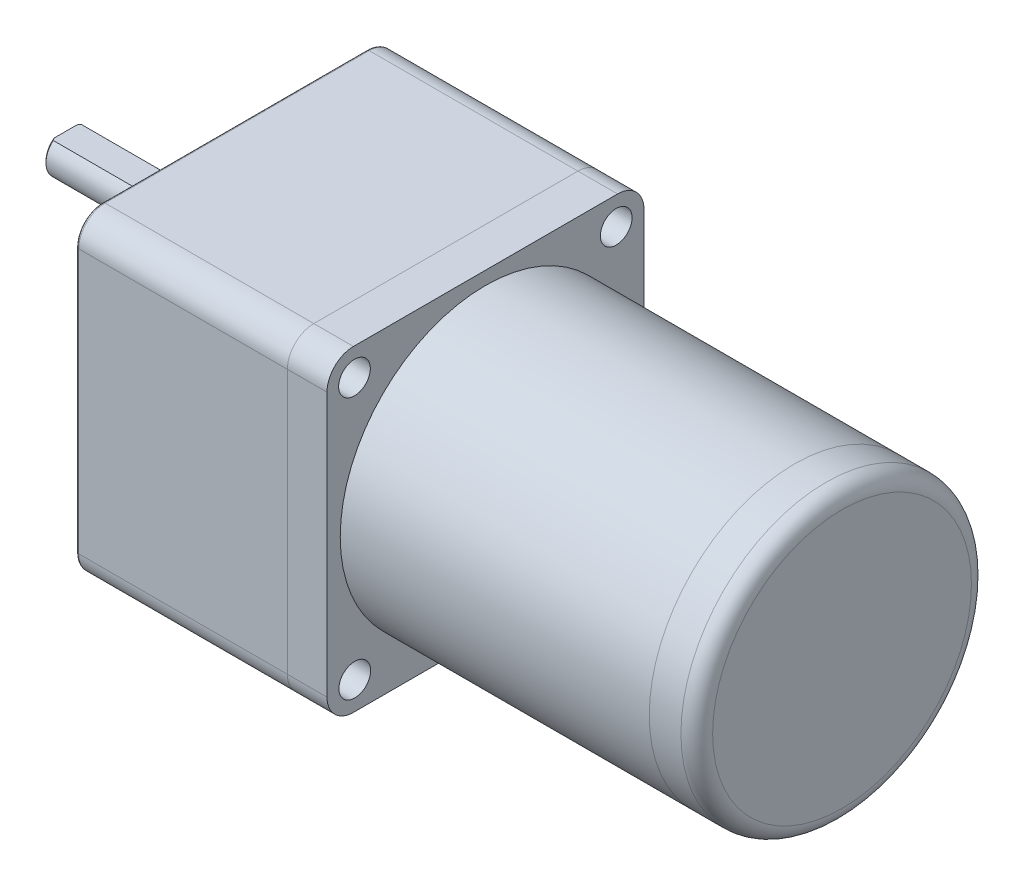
ISO-10303-21;
HEADER;
FILE_DESCRIPTION(('STEP AP214'),'2;1');
FILE_NAME('part.step','',(''),(''),'','','');
FILE_SCHEMA(('AUTOMOTIVE_DESIGN { 1 0 10303 214 1 1 1 1 }'));
ENDSEC;
DATA;
#1=APPLICATION_CONTEXT('core data for automotive mechanical design processes');
#2=APPLICATION_PROTOCOL_DEFINITION('international standard','automotive_design',2000,#1);
#3=PRODUCT_CONTEXT('',#1,'mechanical');
#4=PRODUCT('Part','Part','',(#3));
#5=PRODUCT_RELATED_PRODUCT_CATEGORY('part','',(#4));
#6=PRODUCT_DEFINITION_FORMATION('','',#4);
#7=PRODUCT_DEFINITION_CONTEXT('part definition',#1,'design');
#8=PRODUCT_DEFINITION('design','',#6,#7);
#9=PRODUCT_DEFINITION_SHAPE('','',#8);
#10=(LENGTH_UNIT() NAMED_UNIT(*) SI_UNIT(.MILLI.,.METRE.));
#11=(NAMED_UNIT(*) PLANE_ANGLE_UNIT() SI_UNIT($,.RADIAN.));
#12=(NAMED_UNIT(*) SI_UNIT($,.STERADIAN.) SOLID_ANGLE_UNIT());
#13=UNCERTAINTY_MEASURE_WITH_UNIT(LENGTH_MEASURE(1.E-05),#10,'distance_accuracy_value','');
#14=(GEOMETRIC_REPRESENTATION_CONTEXT(3) GLOBAL_UNCERTAINTY_ASSIGNED_CONTEXT((#13)) GLOBAL_UNIT_ASSIGNED_CONTEXT((#10,
#11,#12)) REPRESENTATION_CONTEXT('',''));
#15=CARTESIAN_POINT('',(0.,0.,0.));
#16=DIRECTION('',(0.,0.,1.));
#17=DIRECTION('',(1.,0.,0.));
#18=AXIS2_PLACEMENT_3D('',#15,#16,#17);
#19=CARTESIAN_POINT('',(-32.,10.,0.));
#20=DIRECTION('',(1.,0.,0.));
#21=DIRECTION('',(0.,0.,-1.));
#22=AXIS2_PLACEMENT_3D('',#19,#20,#21);
#23=CYLINDRICAL_SURFACE('',#22,4.);
#24=DIRECTION('',(-1.,0.,0.));
#25=VECTOR('',#24,1.);
#26=CARTESIAN_POINT('',(-7.,13.,2.64575131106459));
#27=LINE('',#26,#25);
#28=CARTESIAN_POINT('',(-7.,13.,2.64575131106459));
#29=VERTEX_POINT('',#28);
#30=CARTESIAN_POINT('',(-31.7,13.,2.64575131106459));
#31=VERTEX_POINT('',#30);
#32=EDGE_CURVE('E89',#29,#31,#27,.T.);
#33=ORIENTED_EDGE('',*,*,#32,.T.);
#34=CARTESIAN_POINT('',(-31.7,10.,0.));
#35=DIRECTION('',(-1.,0.,0.));
#36=DIRECTION('',(0.,0.,1.));
#37=AXIS2_PLACEMENT_3D('',#34,#35,#36);
#38=CIRCLE('',#37,4.);
#39=CARTESIAN_POINT('',(-31.7,13.,-2.64575131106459));
#40=VERTEX_POINT('',#39);
#41=EDGE_CURVE('E12',#31,#40,#38,.F.);
#42=ORIENTED_EDGE('',*,*,#41,.T.);
#43=DIRECTION('',(-1.,0.,0.));
#44=VECTOR('',#43,1.);
#45=CARTESIAN_POINT('',(-7.,13.,-2.64575131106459));
#46=LINE('',#45,#44);
#47=CARTESIAN_POINT('',(-7.,13.,-2.64575131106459));
#48=VERTEX_POINT('',#47);
#49=EDGE_CURVE('E87',#48,#40,#46,.T.);
#50=ORIENTED_EDGE('',*,*,#49,.F.);
#51=CARTESIAN_POINT('',(-7.,10.,0.));
#52=DIRECTION('',(-1.,0.,0.));
#53=DIRECTION('',(0.,0.,1.));
#54=AXIS2_PLACEMENT_3D('',#51,#52,#53);
#55=CIRCLE('',#54,4.);
#56=EDGE_CURVE('E80',#29,#48,#55,.T.);
#57=ORIENTED_EDGE('',*,*,#56,.F.);
#58=EDGE_LOOP('',(#33,#42,#50,#57));
#59=FACE_BOUND('',#58,.T.);
#60=CARTESIAN_POINT('',(-3.,10.,0.));
#61=DIRECTION('',(-1.,0.,0.));
#62=DIRECTION('',(0.,0.,1.));
#63=AXIS2_PLACEMENT_3D('',#60,#61,#62);
#64=CIRCLE('',#63,4.);
#65=CARTESIAN_POINT('',(-3.,10.,4.));
#66=VERTEX_POINT('',#65);
#67=EDGE_CURVE('E93',#66,#66,#64,.T.);
#68=ORIENTED_EDGE('',*,*,#67,.T.);
#69=EDGE_LOOP('',(#68));
#70=FACE_BOUND('',#69,.T.);
#71=ADVANCED_FACE('F46',(#59,#70),#23,.T.);
#72=CARTESIAN_POINT('',(-32.,10.,0.));
#73=DIRECTION('',(-1.,0.,0.));
#74=DIRECTION('',(0.,0.,1.));
#75=AXIS2_PLACEMENT_3D('',#72,#73,#74);
#76=PLANE('',#75);
#77=DIRECTION('',(0.,0.,1.));
#78=VECTOR('',#77,1.);
#79=CARTESIAN_POINT('',(-32.,13.,2.64575131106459));
#80=LINE('',#79,#78);
#81=CARTESIAN_POINT('',(-32.,13.,-2.16564078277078));
#82=VERTEX_POINT('',#81);
#83=CARTESIAN_POINT('',(-32.,13.,2.16564078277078));
#84=VERTEX_POINT('',#83);
#85=EDGE_CURVE('E84',#82,#84,#80,.T.);
#86=ORIENTED_EDGE('',*,*,#85,.F.);
#87=CARTESIAN_POINT('',(-32.,10.,0.));
#88=DIRECTION('',(-1.,0.,0.));
#89=DIRECTION('',(0.,0.,1.));
#90=AXIS2_PLACEMENT_3D('',#87,#88,#89);
#91=CIRCLE('',#90,3.70000000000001);
#92=EDGE_CURVE('E99',#82,#84,#91,.T.);
#93=ORIENTED_EDGE('',*,*,#92,.T.);
#94=EDGE_LOOP('',(#86,#93));
#95=FACE_BOUND('',#94,.T.);
#96=ADVANCED_FACE('F115',(#95),#76,.T.);
#97=CARTESIAN_POINT('',(-3.,10.,0.));
#98=DIRECTION('',(-1.,0.,0.));
#99=DIRECTION('',(0.,0.,1.));
#100=AXIS2_PLACEMENT_3D('',#97,#98,#99);
#101=PLANE('',#100);
#102=ORIENTED_EDGE('',*,*,#67,.F.);
#103=EDGE_LOOP('',(#102));
#104=FACE_BOUND('',#103,.T.);
#105=ADVANCED_FACE('F114',(#104),#101,.F.);
#106=CARTESIAN_POINT('',(-7.,13.,2.64575131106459));
#107=DIRECTION('',(0.,-1.,0.));
#108=DIRECTION('',(0.,0.,-1.));
#109=AXIS2_PLACEMENT_3D('',#106,#107,#108);
#110=PLANE('',#109);
#111=ORIENTED_EDGE('',*,*,#85,.T.);
#112=CARTESIAN_POINT('',(-32.,13.,2.16564078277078));
#113=CARTESIAN_POINT('',(-31.9761619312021,13.,2.20636622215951));
#114=CARTESIAN_POINT('',(-31.95199678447,13.,2.2468991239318));
#115=CARTESIAN_POINT('',(-31.9030718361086,13.,2.32759423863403));
#116=CARTESIAN_POINT('',(-31.8783121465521,13.,2.36775651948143));
#117=CARTESIAN_POINT('',(-31.8282492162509,13.,2.44773910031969));
#118=CARTESIAN_POINT('',(-31.80294598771,13.,2.48755940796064));
#119=CARTESIAN_POINT('',(-31.7518371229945,13.,2.56688695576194));
#120=CARTESIAN_POINT('',(-31.7260313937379,13.,2.60639413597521));
#121=CARTESIAN_POINT('',(-31.7000000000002,13.,2.64575131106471));
#122=B_SPLINE_CURVE_WITH_KNOTS('',3,(#112,#113,#114,#115,#116,#117,#118,#119,#120,#121),
.UNSPECIFIED.,.F.,.F.,(4,2,2,2,4),(0.,0.141564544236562,0.28310260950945,0.424637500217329,
0.566198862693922),.UNSPECIFIED.);
#123=EDGE_CURVE('E55',#84,#31,#122,.T.);
#124=ORIENTED_EDGE('',*,*,#123,.T.);
#125=ORIENTED_EDGE('',*,*,#32,.F.);
#126=DIRECTION('',(0.,0.,1.));
#127=VECTOR('',#126,1.);
#128=CARTESIAN_POINT('',(-7.,13.,2.64575131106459));
#129=LINE('',#128,#127);
#130=EDGE_CURVE('E83',#48,#29,#129,.T.);
#131=ORIENTED_EDGE('',*,*,#130,.F.);
#132=ORIENTED_EDGE('',*,*,#49,.T.);
#133=CARTESIAN_POINT('',(-31.7,13.,-2.64575131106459));
#134=CARTESIAN_POINT('',(-31.7260313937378,13.,-2.60639413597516));
#135=CARTESIAN_POINT('',(-31.7518371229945,13.,-2.56688695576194));
#136=CARTESIAN_POINT('',(-31.80294598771,13.,-2.48755940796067));
#137=CARTESIAN_POINT('',(-31.8282492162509,13.,-2.44773910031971));
#138=CARTESIAN_POINT('',(-31.878312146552,13.,-2.36775651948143));
#139=CARTESIAN_POINT('',(-31.9030718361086,13.,-2.32759423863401));
#140=CARTESIAN_POINT('',(-31.9519967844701,13.,-2.24689912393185));
#141=CARTESIAN_POINT('',(-31.9761619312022,13.,-2.20636622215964));
#142=CARTESIAN_POINT('',(-32.0000000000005,13.,-2.16564078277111));
#143=B_SPLINE_CURVE_WITH_KNOTS('',3,(#133,#134,#135,#136,#137,#138,#139,#140,#141,#142),
.UNSPECIFIED.,.F.,.F.,(4,2,2,2,4),(0.,0.141561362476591,0.283096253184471,0.424634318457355,
0.566198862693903),.UNSPECIFIED.);
#144=EDGE_CURVE('E102',#40,#82,#143,.T.);
#145=ORIENTED_EDGE('',*,*,#144,.T.);
#146=EDGE_LOOP('',(#111,#124,#125,#131,#132,#145));
#147=FACE_BOUND('',#146,.T.);
#148=ADVANCED_FACE('F86',(#147),#110,.F.);
#149=CARTESIAN_POINT('',(-7.,10.,0.));
#150=DIRECTION('',(-1.,0.,0.));
#151=DIRECTION('',(0.,0.,1.));
#152=AXIS2_PLACEMENT_3D('',#149,#150,#151);
#153=PLANE('',#152);
#154=ORIENTED_EDGE('',*,*,#56,.T.);
#155=ORIENTED_EDGE('',*,*,#130,.T.);
#156=EDGE_LOOP('',(#154,#155));
#157=FACE_BOUND('',#156,.T.);
#158=ADVANCED_FACE('F82',(#157),#153,.T.);
#159=CARTESIAN_POINT('',(-32.,10.,0.));
#160=DIRECTION('',(1.,0.,0.));
#161=DIRECTION('',(0.,0.,-1.));
#162=AXIS2_PLACEMENT_3D('',#159,#160,#161);
#163=CONICAL_SURFACE('',#162,3.70000000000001,0.785398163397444);
#164=ORIENTED_EDGE('',*,*,#144,.F.);
#165=ORIENTED_EDGE('',*,*,#41,.F.);
#166=ORIENTED_EDGE('',*,*,#123,.F.);
#167=ORIENTED_EDGE('',*,*,#92,.F.);
#168=EDGE_LOOP('',(#164,#165,#166,#167));
#169=FACE_BOUND('',#168,.T.);
#170=ADVANCED_FACE('F48',(#169),#163,.T.);
#171=CLOSED_SHELL('',(#71,#96,#105,#148,#158,#170));
#172=MANIFOLD_SOLID_BREP('B2',#171);
#173=CARTESIAN_POINT('',(-3.,10.,0.));
#174=DIRECTION('',(1.,0.,0.));
#175=DIRECTION('',(0.,0.,-1.));
#176=AXIS2_PLACEMENT_3D('',#173,#174,#175);
#177=CYLINDRICAL_SURFACE('',#176,12.);
#178=CARTESIAN_POINT('',(-2.5,10.,0.));
#179=DIRECTION('',(-1.,0.,0.));
#180=DIRECTION('',(0.,0.,1.));
#181=AXIS2_PLACEMENT_3D('',#178,#179,#180);
#182=CIRCLE('',#181,12.);
#183=CARTESIAN_POINT('',(-2.5,10.,12.));
#184=VERTEX_POINT('',#183);
#185=EDGE_CURVE('E45',#184,#184,#182,.F.);
#186=ORIENTED_EDGE('',*,*,#185,.T.);
#187=EDGE_LOOP('',(#186));
#188=FACE_BOUND('',#187,.T.);
#189=CARTESIAN_POINT('',(0.,10.,0.));
#190=DIRECTION('',(-1.,0.,0.));
#191=DIRECTION('',(0.,0.,1.));
#192=AXIS2_PLACEMENT_3D('',#189,#190,#191);
#193=CIRCLE('',#192,12.);
#194=CARTESIAN_POINT('',(0.,10.,12.));
#195=VERTEX_POINT('',#194);
#196=EDGE_CURVE('E188',#195,#195,#193,.T.);
#197=ORIENTED_EDGE('',*,*,#196,.T.);
#198=EDGE_LOOP('',(#197));
#199=FACE_BOUND('',#198,.T.);
#200=ADVANCED_FACE('F177',(#188,#199),#177,.T.);
#201=CARTESIAN_POINT('',(-3.,10.,0.));
#202=DIRECTION('',(-1.,0.,0.));
#203=DIRECTION('',(0.,0.,1.));
#204=AXIS2_PLACEMENT_3D('',#201,#202,#203);
#205=PLANE('',#204);
#206=CARTESIAN_POINT('',(-3.,10.,0.));
#207=DIRECTION('',(-1.,0.,0.));
#208=DIRECTION('',(0.,0.,1.));
#209=AXIS2_PLACEMENT_3D('',#206,#207,#208);
#210=CIRCLE('',#209,11.5);
#211=CARTESIAN_POINT('',(-3.,10.,11.5));
#212=VERTEX_POINT('',#211);
#213=EDGE_CURVE('E184',#212,#212,#210,.T.);
#214=ORIENTED_EDGE('',*,*,#213,.T.);
#215=EDGE_LOOP('',(#214));
#216=FACE_BOUND('',#215,.T.);
#217=ADVANCED_FACE('F198',(#216),#205,.T.);
#218=CARTESIAN_POINT('',(0.,10.,0.));
#219=DIRECTION('',(-1.,0.,0.));
#220=DIRECTION('',(0.,0.,1.));
#221=AXIS2_PLACEMENT_3D('',#218,#219,#220);
#222=PLANE('',#221);
#223=ORIENTED_EDGE('',*,*,#196,.F.);
#224=EDGE_LOOP('',(#223));
#225=FACE_BOUND('',#224,.T.);
#226=ADVANCED_FACE('F196',(#225),#222,.F.);
#227=CARTESIAN_POINT('',(-2.5,10.,0.));
#228=DIRECTION('',(-1.,0.,0.));
#229=DIRECTION('',(0.,0.,1.));
#230=AXIS2_PLACEMENT_3D('',#227,#228,#229);
#231=TOROIDAL_SURFACE('',#230,11.5,0.5);
#232=ORIENTED_EDGE('',*,*,#185,.F.);
#233=EDGE_LOOP('',(#232));
#234=FACE_BOUND('',#233,.T.);
#235=ORIENTED_EDGE('',*,*,#213,.F.);
#236=EDGE_LOOP('',(#235));
#237=FACE_BOUND('',#236,.T.);
#238=ADVANCED_FACE('F179',(#234,#237),#231,.T.);
#239=CLOSED_SHELL('',(#200,#217,#226,#238));
#240=MANIFOLD_SOLID_BREP('B6',#239);
#241=CARTESIAN_POINT('',(115.,0.,0.));
#242=DIRECTION('',(-1.,0.,0.));
#243=DIRECTION('',(0.,0.,1.));
#244=AXIS2_PLACEMENT_3D('',#241,#242,#243);
#245=CYLINDRICAL_SURFACE('',#244,27.5);
#246=CARTESIAN_POINT('',(112.,0.,0.));
#247=DIRECTION('',(1.,0.,0.));
#248=DIRECTION('',(0.,0.,-1.));
#249=AXIS2_PLACEMENT_3D('',#246,#247,#248);
#250=CIRCLE('',#249,27.5);
#251=CARTESIAN_POINT('',(112.,0.,-27.5));
#252=VERTEX_POINT('',#251);
#253=EDGE_CURVE('E176',#252,#252,#250,.F.);
#254=ORIENTED_EDGE('',*,*,#253,.T.);
#255=EDGE_LOOP('',(#254));
#256=FACE_BOUND('',#255,.T.);
#257=CARTESIAN_POINT('',(106.,0.,0.));
#258=DIRECTION('',(1.,0.,0.));
#259=DIRECTION('',(0.,0.,-1.));
#260=AXIS2_PLACEMENT_3D('',#257,#258,#259);
#261=CIRCLE('',#260,27.5);
#262=CARTESIAN_POINT('',(106.,0.,-27.5));
#263=VERTEX_POINT('',#262);
#264=EDGE_CURVE('E252',#263,#263,#261,.T.);
#265=ORIENTED_EDGE('',*,*,#264,.T.);
#266=EDGE_LOOP('',(#265));
#267=FACE_BOUND('',#266,.T.);
#268=ADVANCED_FACE('F241',(#256,#267),#245,.T.);
#269=CARTESIAN_POINT('',(115.,0.,0.));
#270=DIRECTION('',(1.,0.,0.));
#271=DIRECTION('',(0.,0.,-1.));
#272=AXIS2_PLACEMENT_3D('',#269,#270,#271);
#273=PLANE('',#272);
#274=CARTESIAN_POINT('',(115.,0.,0.));
#275=DIRECTION('',(1.,0.,0.));
#276=DIRECTION('',(0.,0.,-1.));
#277=AXIS2_PLACEMENT_3D('',#274,#275,#276);
#278=CIRCLE('',#277,24.5);
#279=CARTESIAN_POINT('',(115.,0.,-24.5));
#280=VERTEX_POINT('',#279);
#281=EDGE_CURVE('E248',#280,#280,#278,.T.);
#282=ORIENTED_EDGE('',*,*,#281,.T.);
#283=EDGE_LOOP('',(#282));
#284=FACE_BOUND('',#283,.T.);
#285=ADVANCED_FACE('F262',(#284),#273,.T.);
#286=CARTESIAN_POINT('',(106.,0.,0.));
#287=DIRECTION('',(1.,0.,0.));
#288=DIRECTION('',(0.,0.,-1.));
#289=AXIS2_PLACEMENT_3D('',#286,#287,#288);
#290=PLANE('',#289);
#291=ORIENTED_EDGE('',*,*,#264,.F.);
#292=EDGE_LOOP('',(#291));
#293=FACE_BOUND('',#292,.T.);
#294=ADVANCED_FACE('F260',(#293),#290,.F.);
#295=CARTESIAN_POINT('',(112.,0.,0.));
#296=DIRECTION('',(1.,0.,0.));
#297=DIRECTION('',(0.,0.,-1.));
#298=AXIS2_PLACEMENT_3D('',#295,#296,#297);
#299=TOROIDAL_SURFACE('',#298,24.5,3.);
#300=ORIENTED_EDGE('',*,*,#253,.F.);
#301=EDGE_LOOP('',(#300));
#302=FACE_BOUND('',#301,.T.);
#303=ORIENTED_EDGE('',*,*,#281,.F.);
#304=EDGE_LOOP('',(#303));
#305=FACE_BOUND('',#304,.T.);
#306=ADVANCED_FACE('F243',(#302,#305),#299,.T.);
#307=CLOSED_SHELL('',(#268,#285,#294,#306));
#308=MANIFOLD_SOLID_BREP('B40',#307);
#309=CARTESIAN_POINT('',(106.,0.,0.));
#310=DIRECTION('',(-1.,0.,0.));
#311=DIRECTION('',(0.,0.,1.));
#312=AXIS2_PLACEMENT_3D('',#309,#310,#311);
#313=CYLINDRICAL_SURFACE('',#312,27.5);
#314=CARTESIAN_POINT('',(106.,0.,0.));
#315=DIRECTION('',(1.,0.,0.));
#316=DIRECTION('',(0.,0.,-1.));
#317=AXIS2_PLACEMENT_3D('',#314,#315,#316);
#318=CIRCLE('',#317,27.5);
#319=CARTESIAN_POINT('',(106.,0.,-27.5));
#320=VERTEX_POINT('',#319);
#321=EDGE_CURVE('E240',#320,#320,#318,.T.);
#322=ORIENTED_EDGE('',*,*,#321,.F.);
#323=EDGE_LOOP('',(#322));
#324=FACE_BOUND('',#323,.T.);
#325=CARTESIAN_POINT('',(47.5,0.,0.));
#326=DIRECTION('',(1.,0.,0.));
#327=DIRECTION('',(0.,0.,-1.));
#328=AXIS2_PLACEMENT_3D('',#325,#326,#327);
#329=CIRCLE('',#328,27.5);
#330=CARTESIAN_POINT('',(47.5,0.,-27.5));
#331=VERTEX_POINT('',#330);
#332=EDGE_CURVE('E310',#331,#331,#329,.T.);
#333=ORIENTED_EDGE('',*,*,#332,.T.);
#334=EDGE_LOOP('',(#333));
#335=FACE_BOUND('',#334,.T.);
#336=ADVANCED_FACE('F307',(#324,#335),#313,.T.);
#337=CARTESIAN_POINT('',(106.,0.,0.));
#338=DIRECTION('',(1.,0.,0.));
#339=DIRECTION('',(0.,0.,-1.));
#340=AXIS2_PLACEMENT_3D('',#337,#338,#339);
#341=PLANE('',#340);
#342=ORIENTED_EDGE('',*,*,#321,.T.);
#343=EDGE_LOOP('',(#342));
#344=FACE_BOUND('',#343,.T.);
#345=ADVANCED_FACE('F322',(#344),#341,.T.);
#346=CARTESIAN_POINT('',(47.5,0.,0.));
#347=DIRECTION('',(1.,0.,0.));
#348=DIRECTION('',(0.,0.,-1.));
#349=AXIS2_PLACEMENT_3D('',#346,#347,#348);
#350=PLANE('',#349);
#351=ORIENTED_EDGE('',*,*,#332,.F.);
#352=EDGE_LOOP('',(#351));
#353=FACE_BOUND('',#352,.T.);
#354=ADVANCED_FACE('F320',(#353),#350,.F.);
#355=CLOSED_SHELL('',(#336,#345,#354));
#356=MANIFOLD_SOLID_BREP('B171',#355);
#357=CARTESIAN_POINT('',(47.5,25.,-25.));
#358=DIRECTION('',(-1.,0.,0.));
#359=DIRECTION('',(0.,0.,1.));
#360=AXIS2_PLACEMENT_3D('',#357,#358,#359);
#361=CYLINDRICAL_SURFACE('',#360,5.);
#362=CARTESIAN_POINT('',(40.,25.,-25.));
#363=DIRECTION('',(1.,0.,0.));
#364=DIRECTION('',(0.,0.,1.));
#365=AXIS2_PLACEMENT_3D('',#362,#363,#364);
#366=CIRCLE('',#365,5.);
#367=CARTESIAN_POINT('',(40.,25.,-30.));
#368=VERTEX_POINT('',#367);
#369=CARTESIAN_POINT('',(40.,30.,-25.));
#370=VERTEX_POINT('',#369);
#371=EDGE_CURVE('E455',#368,#370,#366,.T.);
#372=ORIENTED_EDGE('',*,*,#371,.T.);
#373=DIRECTION('',(-1.,0.,0.));
#374=VECTOR('',#373,1.);
#375=CARTESIAN_POINT('',(47.5,30.,-25.));
#376=LINE('',#375,#374);
#377=CARTESIAN_POINT('',(47.5,30.,-25.));
#378=VERTEX_POINT('',#377);
#379=EDGE_CURVE('E305',#378,#370,#376,.T.);
#380=ORIENTED_EDGE('',*,*,#379,.F.);
#381=CARTESIAN_POINT('',(47.5,25.,-25.));
#382=DIRECTION('',(1.,0.,0.));
#383=DIRECTION('',(0.,0.,1.));
#384=AXIS2_PLACEMENT_3D('',#381,#382,#383);
#385=CIRCLE('',#384,5.);
#386=CARTESIAN_POINT('',(47.5,25.,-30.));
#387=VERTEX_POINT('',#386);
#388=EDGE_CURVE('E469',#387,#378,#385,.T.);
#389=ORIENTED_EDGE('',*,*,#388,.F.);
#390=DIRECTION('',(-1.,0.,0.));
#391=VECTOR('',#390,1.);
#392=CARTESIAN_POINT('',(47.5,25.,-30.));
#393=LINE('',#392,#391);
#394=EDGE_CURVE('E451',#387,#368,#393,.T.);
#395=ORIENTED_EDGE('',*,*,#394,.T.);
#396=EDGE_LOOP('',(#372,#380,#389,#395));
#397=FACE_BOUND('',#396,.T.);
#398=ADVANCED_FACE('F357',(#397),#361,.T.);
#399=CARTESIAN_POINT('',(47.5,30.,25.));
#400=DIRECTION('',(0.,-1.,0.));
#401=DIRECTION('',(0.,0.,-1.));
#402=AXIS2_PLACEMENT_3D('',#399,#400,#401);
#403=PLANE('',#402);
#404=DIRECTION('',(0.,0.,1.));
#405=VECTOR('',#404,1.);
#406=CARTESIAN_POINT('',(40.,30.,25.));
#407=LINE('',#406,#405);
#408=CARTESIAN_POINT('',(40.,30.,25.));
#409=VERTEX_POINT('',#408);
#410=EDGE_CURVE('E458',#370,#409,#407,.T.);
#411=ORIENTED_EDGE('',*,*,#410,.T.);
#412=DIRECTION('',(-1.,0.,0.));
#413=VECTOR('',#412,1.);
#414=CARTESIAN_POINT('',(47.5,30.,25.));
#415=LINE('',#414,#413);
#416=CARTESIAN_POINT('',(47.5,30.,25.));
#417=VERTEX_POINT('',#416);
#418=EDGE_CURVE('E366',#417,#409,#415,.T.);
#419=ORIENTED_EDGE('',*,*,#418,.F.);
#420=DIRECTION('',(0.,0.,1.));
#421=VECTOR('',#420,1.);
#422=CARTESIAN_POINT('',(47.5,30.,25.));
#423=LINE('',#422,#421);
#424=EDGE_CURVE('E418',#378,#417,#423,.T.);
#425=ORIENTED_EDGE('',*,*,#424,.F.);
#426=ORIENTED_EDGE('',*,*,#379,.T.);
#427=EDGE_LOOP('',(#411,#419,#425,#426));
#428=FACE_BOUND('',#427,.T.);
#429=ADVANCED_FACE('F523',(#428),#403,.F.);
#430=CARTESIAN_POINT('',(47.5,25.,25.));
#431=DIRECTION('',(-1.,0.,0.));
#432=DIRECTION('',(0.,0.,1.));
#433=AXIS2_PLACEMENT_3D('',#430,#431,#432);
#434=CYLINDRICAL_SURFACE('',#433,5.);
#435=CARTESIAN_POINT('',(40.,25.,25.));
#436=DIRECTION('',(1.,0.,0.));
#437=DIRECTION('',(0.,0.,1.));
#438=AXIS2_PLACEMENT_3D('',#435,#436,#437);
#439=CIRCLE('',#438,5.);
#440=CARTESIAN_POINT('',(40.,25.,30.));
#441=VERTEX_POINT('',#440);
#442=EDGE_CURVE('E460',#409,#441,#439,.T.);
#443=ORIENTED_EDGE('',*,*,#442,.T.);
#444=DIRECTION('',(-1.,0.,0.));
#445=VECTOR('',#444,1.);
#446=CARTESIAN_POINT('',(47.5,25.,30.));
#447=LINE('',#446,#445);
#448=CARTESIAN_POINT('',(47.5,25.,30.));
#449=VERTEX_POINT('',#448);
#450=EDGE_CURVE('E476',#449,#441,#447,.T.);
#451=ORIENTED_EDGE('',*,*,#450,.F.);
#452=CARTESIAN_POINT('',(47.5,25.,25.));
#453=DIRECTION('',(1.,0.,0.));
#454=DIRECTION('',(0.,0.,1.));
#455=AXIS2_PLACEMENT_3D('',#452,#453,#454);
#456=CIRCLE('',#455,5.);
#457=EDGE_CURVE('E624',#417,#449,#456,.T.);
#458=ORIENTED_EDGE('',*,*,#457,.F.);
#459=ORIENTED_EDGE('',*,*,#418,.T.);
#460=EDGE_LOOP('',(#443,#451,#458,#459));
#461=FACE_BOUND('',#460,.T.);
#462=ADVANCED_FACE('F527',(#461),#434,.T.);
#463=CARTESIAN_POINT('',(47.5,-25.,30.));
#464=DIRECTION('',(0.,0.,-1.));
#465=DIRECTION('',(-1.,0.,0.));
#466=AXIS2_PLACEMENT_3D('',#463,#464,#465);
#467=PLANE('',#466);
#468=DIRECTION('',(0.,-1.,0.));
#469=VECTOR('',#468,1.);
#470=CARTESIAN_POINT('',(40.,-25.,30.));
#471=LINE('',#470,#469);
#472=CARTESIAN_POINT('',(40.,-25.,30.));
#473=VERTEX_POINT('',#472);
#474=EDGE_CURVE('E462',#441,#473,#471,.T.);
#475=ORIENTED_EDGE('',*,*,#474,.T.);
#476=DIRECTION('',(-1.,0.,0.));
#477=VECTOR('',#476,1.);
#478=CARTESIAN_POINT('',(47.5,-25.,30.));
#479=LINE('',#478,#477);
#480=CARTESIAN_POINT('',(47.5,-25.,30.));
#481=VERTEX_POINT('',#480);
#482=EDGE_CURVE('E473',#481,#473,#479,.T.);
#483=ORIENTED_EDGE('',*,*,#482,.F.);
#484=DIRECTION('',(0.,-1.,0.));
#485=VECTOR('',#484,1.);
#486=CARTESIAN_POINT('',(47.5,-25.,30.));
#487=LINE('',#486,#485);
#488=EDGE_CURVE('E626',#449,#481,#487,.T.);
#489=ORIENTED_EDGE('',*,*,#488,.F.);
#490=ORIENTED_EDGE('',*,*,#450,.T.);
#491=EDGE_LOOP('',(#475,#483,#489,#490));
#492=FACE_BOUND('',#491,.T.);
#493=ADVANCED_FACE('F531',(#492),#467,.F.);
#494=CARTESIAN_POINT('',(47.5,-25.,25.));
#495=DIRECTION('',(-1.,0.,0.));
#496=DIRECTION('',(0.,0.,1.));
#497=AXIS2_PLACEMENT_3D('',#494,#495,#496);
#498=CYLINDRICAL_SURFACE('',#497,5.);
#499=CARTESIAN_POINT('',(40.,-25.,25.));
#500=DIRECTION('',(1.,0.,0.));
#501=DIRECTION('',(0.,0.,1.));
#502=AXIS2_PLACEMENT_3D('',#499,#500,#501);
#503=CIRCLE('',#502,5.);
#504=CARTESIAN_POINT('',(40.,-30.,25.));
#505=VERTEX_POINT('',#504);
#506=EDGE_CURVE('E464',#473,#505,#503,.T.);
#507=ORIENTED_EDGE('',*,*,#506,.T.);
#508=DIRECTION('',(-1.,0.,0.));
#509=VECTOR('',#508,1.);
#510=CARTESIAN_POINT('',(47.5,-30.,25.));
#511=LINE('',#510,#509);
#512=CARTESIAN_POINT('',(47.5,-30.,25.));
#513=VERTEX_POINT('',#512);
#514=EDGE_CURVE('E446',#513,#505,#511,.T.);
#515=ORIENTED_EDGE('',*,*,#514,.F.);
#516=CARTESIAN_POINT('',(47.5,-25.,25.));
#517=DIRECTION('',(1.,0.,0.));
#518=DIRECTION('',(0.,0.,1.));
#519=AXIS2_PLACEMENT_3D('',#516,#517,#518);
#520=CIRCLE('',#519,5.);
#521=EDGE_CURVE('E437',#481,#513,#520,.T.);
#522=ORIENTED_EDGE('',*,*,#521,.F.);
#523=ORIENTED_EDGE('',*,*,#482,.T.);
#524=EDGE_LOOP('',(#507,#515,#522,#523));
#525=FACE_BOUND('',#524,.T.);
#526=ADVANCED_FACE('F537',(#525),#498,.T.);
#527=CARTESIAN_POINT('',(47.5,-30.,25.));
#528=DIRECTION('',(0.,1.,0.));
#529=DIRECTION('',(0.,0.,1.));
#530=AXIS2_PLACEMENT_3D('',#527,#528,#529);
#531=PLANE('',#530);
#532=DIRECTION('',(0.,0.,-1.));
#533=VECTOR('',#532,1.);
#534=CARTESIAN_POINT('',(40.,-30.,25.));
#535=LINE('',#534,#533);
#536=CARTESIAN_POINT('',(40.,-30.,-25.));
#537=VERTEX_POINT('',#536);
#538=EDGE_CURVE('E445',#505,#537,#535,.T.);
#539=ORIENTED_EDGE('',*,*,#538,.T.);
#540=DIRECTION('',(-1.,0.,0.));
#541=VECTOR('',#540,1.);
#542=CARTESIAN_POINT('',(47.5,-30.,-25.));
#543=LINE('',#542,#541);
#544=CARTESIAN_POINT('',(47.5,-30.,-25.));
#545=VERTEX_POINT('',#544);
#546=EDGE_CURVE('E442',#545,#537,#543,.T.);
#547=ORIENTED_EDGE('',*,*,#546,.F.);
#548=DIRECTION('',(0.,0.,-1.));
#549=VECTOR('',#548,1.);
#550=CARTESIAN_POINT('',(47.5,-30.,25.));
#551=LINE('',#550,#549);
#552=EDGE_CURVE('E431',#513,#545,#551,.T.);
#553=ORIENTED_EDGE('',*,*,#552,.F.);
#554=ORIENTED_EDGE('',*,*,#514,.T.);
#555=EDGE_LOOP('',(#539,#547,#553,#554));
#556=FACE_BOUND('',#555,.T.);
#557=ADVANCED_FACE('F443',(#556),#531,.F.);
#558=CARTESIAN_POINT('',(47.5,-25.,-25.));
#559=DIRECTION('',(-1.,0.,0.));
#560=DIRECTION('',(0.,0.,1.));
#561=AXIS2_PLACEMENT_3D('',#558,#559,#560);
#562=CYLINDRICAL_SURFACE('',#561,5.);
#563=CARTESIAN_POINT('',(40.,-25.,-25.));
#564=DIRECTION('',(1.,0.,0.));
#565=DIRECTION('',(0.,0.,-1.));
#566=AXIS2_PLACEMENT_3D('',#563,#564,#565);
#567=CIRCLE('',#566,5.);
#568=CARTESIAN_POINT('',(40.,-25.,-30.));
#569=VERTEX_POINT('',#568);
#570=EDGE_CURVE('E404',#537,#569,#567,.T.);
#571=ORIENTED_EDGE('',*,*,#570,.T.);
#572=DIRECTION('',(-1.,0.,0.));
#573=VECTOR('',#572,1.);
#574=CARTESIAN_POINT('',(47.5,-25.,-30.));
#575=LINE('',#574,#573);
#576=CARTESIAN_POINT('',(47.5,-25.,-30.));
#577=VERTEX_POINT('',#576);
#578=EDGE_CURVE('E447',#577,#569,#575,.T.);
#579=ORIENTED_EDGE('',*,*,#578,.F.);
#580=CARTESIAN_POINT('',(47.5,-25.,-25.));
#581=DIRECTION('',(1.,0.,0.));
#582=DIRECTION('',(0.,0.,-1.));
#583=AXIS2_PLACEMENT_3D('',#580,#581,#582);
#584=CIRCLE('',#583,5.);
#585=EDGE_CURVE('E435',#545,#577,#584,.T.);
#586=ORIENTED_EDGE('',*,*,#585,.F.);
#587=ORIENTED_EDGE('',*,*,#546,.T.);
#588=EDGE_LOOP('',(#571,#579,#586,#587));
#589=FACE_BOUND('',#588,.T.);
#590=ADVANCED_FACE('F449',(#589),#562,.T.);
#591=CARTESIAN_POINT('',(47.5,-25.,-30.));
#592=DIRECTION('',(0.,0.,1.));
#593=DIRECTION('',(1.,0.,0.));
#594=AXIS2_PLACEMENT_3D('',#591,#592,#593);
#595=PLANE('',#594);
#596=DIRECTION('',(0.,1.,0.));
#597=VECTOR('',#596,1.);
#598=CARTESIAN_POINT('',(40.,-25.,-30.));
#599=LINE('',#598,#597);
#600=EDGE_CURVE('E410',#569,#368,#599,.T.);
#601=ORIENTED_EDGE('',*,*,#600,.T.);
#602=ORIENTED_EDGE('',*,*,#394,.F.);
#603=DIRECTION('',(0.,1.,0.));
#604=VECTOR('',#603,1.);
#605=CARTESIAN_POINT('',(47.5,-25.,-30.));
#606=LINE('',#605,#604);
#607=EDGE_CURVE('E375',#577,#387,#606,.T.);
#608=ORIENTED_EDGE('',*,*,#607,.F.);
#609=ORIENTED_EDGE('',*,*,#578,.T.);
#610=EDGE_LOOP('',(#601,#602,#608,#609));
#611=FACE_BOUND('',#610,.T.);
#612=ADVANCED_FACE('F512',(#611),#595,.F.);
#613=CARTESIAN_POINT('',(47.5,25.,-25.));
#614=DIRECTION('',(-1.,0.,0.));
#615=DIRECTION('',(0.,0.,1.));
#616=AXIS2_PLACEMENT_3D('',#613,#614,#615);
#617=PLANE('',#616);
#618=CARTESIAN_POINT('',(47.5,24.8007290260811,24.8007290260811));
#619=DIRECTION('',(1.,0.,0.));
#620=DIRECTION('',(0.,0.,-1.));
#621=AXIS2_PLACEMENT_3D('',#618,#619,#620);
#622=CIRCLE('',#621,3.);
#623=CARTESIAN_POINT('',(47.5,24.8007290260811,21.8007290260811));
#624=VERTEX_POINT('',#623);
#625=EDGE_CURVE('E485',#624,#624,#622,.T.);
#626=ORIENTED_EDGE('',*,*,#625,.F.);
#627=EDGE_LOOP('',(#626));
#628=FACE_BOUND('',#627,.T.);
#629=CARTESIAN_POINT('',(47.5,24.7487373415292,-24.7487373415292));
#630=DIRECTION('',(1.,0.,0.));
#631=DIRECTION('',(0.,0.,-1.));
#632=AXIS2_PLACEMENT_3D('',#629,#630,#631);
#633=CIRCLE('',#632,3.);
#634=CARTESIAN_POINT('',(47.5,24.7487373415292,-27.7487373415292));
#635=VERTEX_POINT('',#634);
#636=EDGE_CURVE('E610',#635,#635,#633,.T.);
#637=ORIENTED_EDGE('',*,*,#636,.F.);
#638=EDGE_LOOP('',(#637));
#639=FACE_BOUND('',#638,.T.);
#640=CARTESIAN_POINT('',(47.5,-24.7487373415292,-24.7487373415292));
#641=DIRECTION('',(1.,0.,0.));
#642=DIRECTION('',(0.,0.,-1.));
#643=AXIS2_PLACEMENT_3D('',#640,#641,#642);
#644=CIRCLE('',#643,3.);
#645=CARTESIAN_POINT('',(47.5,-24.7487373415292,-27.7487373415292));
#646=VERTEX_POINT('',#645);
#647=EDGE_CURVE('E612',#646,#646,#644,.T.);
#648=ORIENTED_EDGE('',*,*,#647,.F.);
#649=EDGE_LOOP('',(#648));
#650=FACE_BOUND('',#649,.T.);
#651=CARTESIAN_POINT('',(47.5,-24.7487373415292,24.7487373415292));
#652=DIRECTION('',(1.,0.,0.));
#653=DIRECTION('',(0.,0.,-1.));
#654=AXIS2_PLACEMENT_3D('',#651,#652,#653);
#655=CIRCLE('',#654,3.);
#656=CARTESIAN_POINT('',(47.5,-24.7487373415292,21.7487373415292));
#657=VERTEX_POINT('',#656);
#658=EDGE_CURVE('E617',#657,#657,#655,.T.);
#659=ORIENTED_EDGE('',*,*,#658,.F.);
#660=EDGE_LOOP('',(#659));
#661=FACE_BOUND('',#660,.T.);
#662=ORIENTED_EDGE('',*,*,#388,.T.);
#663=ORIENTED_EDGE('',*,*,#424,.T.);
#664=ORIENTED_EDGE('',*,*,#457,.T.);
#665=ORIENTED_EDGE('',*,*,#488,.T.);
#666=ORIENTED_EDGE('',*,*,#521,.T.);
#667=ORIENTED_EDGE('',*,*,#552,.T.);
#668=ORIENTED_EDGE('',*,*,#585,.T.);
#669=ORIENTED_EDGE('',*,*,#607,.T.);
#670=EDGE_LOOP('',(#662,#663,#664,#665,#666,#667,#668,#669));
#671=FACE_BOUND('',#670,.T.);
#672=ADVANCED_FACE('F433',(#628,#639,#650,#661,#671),#617,.F.);
#673=CARTESIAN_POINT('',(40.,25.,-25.));
#674=DIRECTION('',(-1.,0.,0.));
#675=DIRECTION('',(0.,0.,1.));
#676=AXIS2_PLACEMENT_3D('',#673,#674,#675);
#677=PLANE('',#676);
#678=CARTESIAN_POINT('',(40.,24.8007290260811,24.8007290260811));
#679=DIRECTION('',(-1.,0.,0.));
#680=DIRECTION('',(0.,0.,1.));
#681=AXIS2_PLACEMENT_3D('',#678,#679,#680);
#682=CIRCLE('',#681,3.);
#683=CARTESIAN_POINT('',(40.,24.8007290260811,27.8007290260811));
#684=VERTEX_POINT('',#683);
#685=EDGE_CURVE('E360',#684,#684,#682,.T.);
#686=ORIENTED_EDGE('',*,*,#685,.F.);
#687=EDGE_LOOP('',(#686));
#688=FACE_BOUND('',#687,.T.);
#689=CARTESIAN_POINT('',(40.,24.7487373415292,-24.7487373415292));
#690=DIRECTION('',(-1.,0.,0.));
#691=DIRECTION('',(0.,0.,1.));
#692=AXIS2_PLACEMENT_3D('',#689,#690,#691);
#693=CIRCLE('',#692,3.);
#694=CARTESIAN_POINT('',(40.,24.7487373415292,-21.7487373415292));
#695=VERTEX_POINT('',#694);
#696=EDGE_CURVE('E487',#695,#695,#693,.T.);
#697=ORIENTED_EDGE('',*,*,#696,.F.);
#698=EDGE_LOOP('',(#697));
#699=FACE_BOUND('',#698,.T.);
#700=CARTESIAN_POINT('',(40.,-24.7487373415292,-24.7487373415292));
#701=DIRECTION('',(-1.,0.,0.));
#702=DIRECTION('',(0.,0.,1.));
#703=AXIS2_PLACEMENT_3D('',#700,#701,#702);
#704=CIRCLE('',#703,3.);
#705=CARTESIAN_POINT('',(40.,-24.7487373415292,-21.7487373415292));
#706=VERTEX_POINT('',#705);
#707=EDGE_CURVE('E484',#706,#706,#704,.T.);
#708=ORIENTED_EDGE('',*,*,#707,.F.);
#709=EDGE_LOOP('',(#708));
#710=FACE_BOUND('',#709,.T.);
#711=CARTESIAN_POINT('',(40.,-24.7487373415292,24.7487373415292));
#712=DIRECTION('',(-1.,0.,0.));
#713=DIRECTION('',(0.,0.,1.));
#714=AXIS2_PLACEMENT_3D('',#711,#712,#713);
#715=CIRCLE('',#714,3.);
#716=CARTESIAN_POINT('',(40.,-24.7487373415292,27.7487373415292));
#717=VERTEX_POINT('',#716);
#718=EDGE_CURVE('E481',#717,#717,#715,.T.);
#719=ORIENTED_EDGE('',*,*,#718,.F.);
#720=EDGE_LOOP('',(#719));
#721=FACE_BOUND('',#720,.T.);
#722=ORIENTED_EDGE('',*,*,#371,.F.);
#723=ORIENTED_EDGE('',*,*,#600,.F.);
#724=ORIENTED_EDGE('',*,*,#570,.F.);
#725=ORIENTED_EDGE('',*,*,#538,.F.);
#726=ORIENTED_EDGE('',*,*,#506,.F.);
#727=ORIENTED_EDGE('',*,*,#474,.F.);
#728=ORIENTED_EDGE('',*,*,#442,.F.);
#729=ORIENTED_EDGE('',*,*,#410,.F.);
#730=EDGE_LOOP('',(#722,#723,#724,#725,#726,#727,#728,#729));
#731=FACE_BOUND('',#730,.T.);
#732=ADVANCED_FACE('F497',(#688,#699,#710,#721,#731),#677,.T.);
#733=CARTESIAN_POINT('',(14.5,-24.7487373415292,24.7487373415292));
#734=DIRECTION('',(1.,0.,0.));
#735=DIRECTION('',(0.,0.,-1.));
#736=AXIS2_PLACEMENT_3D('',#733,#734,#735);
#737=CYLINDRICAL_SURFACE('',#736,3.);
#738=ORIENTED_EDGE('',*,*,#718,.T.);
#739=EDGE_LOOP('',(#738));
#740=FACE_BOUND('',#739,.T.);
#741=ORIENTED_EDGE('',*,*,#658,.T.);
#742=EDGE_LOOP('',(#741));
#743=FACE_BOUND('',#742,.T.);
#744=ADVANCED_FACE('F500',(#740,#743),#737,.F.);
#745=CARTESIAN_POINT('',(14.5,-24.7487373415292,-24.7487373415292));
#746=DIRECTION('',(1.,0.,0.));
#747=DIRECTION('',(0.,0.,-1.));
#748=AXIS2_PLACEMENT_3D('',#745,#746,#747);
#749=CYLINDRICAL_SURFACE('',#748,3.);
#750=ORIENTED_EDGE('',*,*,#707,.T.);
#751=EDGE_LOOP('',(#750));
#752=FACE_BOUND('',#751,.T.);
#753=ORIENTED_EDGE('',*,*,#647,.T.);
#754=EDGE_LOOP('',(#753));
#755=FACE_BOUND('',#754,.T.);
#756=ADVANCED_FACE('F576',(#752,#755),#749,.F.);
#757=CARTESIAN_POINT('',(14.5,24.7487373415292,-24.7487373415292));
#758=DIRECTION('',(1.,0.,0.));
#759=DIRECTION('',(0.,0.,-1.));
#760=AXIS2_PLACEMENT_3D('',#757,#758,#759);
#761=CYLINDRICAL_SURFACE('',#760,3.);
#762=ORIENTED_EDGE('',*,*,#696,.T.);
#763=EDGE_LOOP('',(#762));
#764=FACE_BOUND('',#763,.T.);
#765=ORIENTED_EDGE('',*,*,#636,.T.);
#766=EDGE_LOOP('',(#765));
#767=FACE_BOUND('',#766,.T.);
#768=ADVANCED_FACE('F586',(#764,#767),#761,.F.);
#769=CARTESIAN_POINT('',(14.5,24.8007290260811,24.8007290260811));
#770=DIRECTION('',(1.,0.,0.));
#771=DIRECTION('',(0.,0.,-1.));
#772=AXIS2_PLACEMENT_3D('',#769,#770,#771);
#773=CYLINDRICAL_SURFACE('',#772,3.);
#774=ORIENTED_EDGE('',*,*,#685,.T.);
#775=EDGE_LOOP('',(#774));
#776=FACE_BOUND('',#775,.T.);
#777=ORIENTED_EDGE('',*,*,#625,.T.);
#778=EDGE_LOOP('',(#777));
#779=FACE_BOUND('',#778,.T.);
#780=ADVANCED_FACE('F494',(#776,#779),#773,.F.);
#781=CLOSED_SHELL('',(#398,#429,#462,#493,#526,#557,#590,#612,#672,#732,#744,#756,#768,#780));
#782=MANIFOLD_SOLID_BREP('B235',#781);
#783=CARTESIAN_POINT('',(40.,-25.,25.));
#784=DIRECTION('',(-1.,0.,0.));
#785=DIRECTION('',(0.,0.,1.));
#786=AXIS2_PLACEMENT_3D('',#783,#784,#785);
#787=CYLINDRICAL_SURFACE('',#786,5.);
#788=DIRECTION('',(-1.,0.,0.));
#789=VECTOR('',#788,1.);
#790=CARTESIAN_POINT('',(40.,-25.,30.));
#791=LINE('',#790,#789);
#792=CARTESIAN_POINT('',(40.,-25.,30.));
#793=VERTEX_POINT('',#792);
#794=CARTESIAN_POINT('',(0.5,-25.,30.));
#795=VERTEX_POINT('',#794);
#796=EDGE_CURVE('E827',#793,#795,#791,.T.);
#797=ORIENTED_EDGE('',*,*,#796,.T.);
#798=CARTESIAN_POINT('',(0.5,-25.,25.));
#799=DIRECTION('',(-1.,0.,0.));
#800=DIRECTION('',(0.,0.,1.));
#801=AXIS2_PLACEMENT_3D('',#798,#799,#800);
#802=CIRCLE('',#801,5.);
#803=CARTESIAN_POINT('',(0.5,-30.,25.));
#804=VERTEX_POINT('',#803);
#805=EDGE_CURVE('E355',#795,#804,#802,.F.);
#806=ORIENTED_EDGE('',*,*,#805,.T.);
#807=DIRECTION('',(-1.,0.,0.));
#808=VECTOR('',#807,1.);
#809=CARTESIAN_POINT('',(40.,-30.,25.));
#810=LINE('',#809,#808);
#811=CARTESIAN_POINT('',(40.,-30.,25.));
#812=VERTEX_POINT('',#811);
#813=EDGE_CURVE('E845',#812,#804,#810,.T.);
#814=ORIENTED_EDGE('',*,*,#813,.F.);
#815=CARTESIAN_POINT('',(40.,-25.,25.));
#816=DIRECTION('',(1.,0.,0.));
#817=DIRECTION('',(0.,0.,1.));
#818=AXIS2_PLACEMENT_3D('',#815,#816,#817);
#819=CIRCLE('',#818,5.);
#820=EDGE_CURVE('E809',#793,#812,#819,.T.);
#821=ORIENTED_EDGE('',*,*,#820,.F.);
#822=EDGE_LOOP('',(#797,#806,#814,#821));
#823=FACE_BOUND('',#822,.T.);
#824=ADVANCED_FACE('F669',(#823),#787,.T.);
#825=CARTESIAN_POINT('',(40.,-30.,25.));
#826=DIRECTION('',(0.,1.,0.));
#827=DIRECTION('',(0.,0.,1.));
#828=AXIS2_PLACEMENT_3D('',#825,#826,#827);
#829=PLANE('',#828);
#830=ORIENTED_EDGE('',*,*,#813,.T.);
#831=DIRECTION('',(0.,0.,-1.));
#832=VECTOR('',#831,1.);
#833=CARTESIAN_POINT('',(0.5,-30.,-25.));
#834=LINE('',#833,#832);
#835=CARTESIAN_POINT('',(0.5,-30.,-25.));
#836=VERTEX_POINT('',#835);
#837=EDGE_CURVE('E851',#804,#836,#834,.T.);
#838=ORIENTED_EDGE('',*,*,#837,.T.);
#839=DIRECTION('',(-1.,0.,0.));
#840=VECTOR('',#839,1.);
#841=CARTESIAN_POINT('',(40.,-30.,-25.));
#842=LINE('',#841,#840);
#843=CARTESIAN_POINT('',(40.,-30.,-25.));
#844=VERTEX_POINT('',#843);
#845=EDGE_CURVE('E842',#844,#836,#842,.T.);
#846=ORIENTED_EDGE('',*,*,#845,.F.);
#847=DIRECTION('',(0.,0.,-1.));
#848=VECTOR('',#847,1.);
#849=CARTESIAN_POINT('',(40.,-30.,25.));
#850=LINE('',#849,#848);
#851=EDGE_CURVE('E813',#812,#844,#850,.T.);
#852=ORIENTED_EDGE('',*,*,#851,.F.);
#853=EDGE_LOOP('',(#830,#838,#846,#852));
#854=FACE_BOUND('',#853,.T.);
#855=ADVANCED_FACE('F933',(#854),#829,.F.);
#856=CARTESIAN_POINT('',(40.,-25.,-25.));
#857=DIRECTION('',(-1.,0.,0.));
#858=DIRECTION('',(0.,0.,1.));
#859=AXIS2_PLACEMENT_3D('',#856,#857,#858);
#860=CYLINDRICAL_SURFACE('',#859,5.);
#861=ORIENTED_EDGE('',*,*,#845,.T.);
#862=CARTESIAN_POINT('',(0.5,-25.,-25.));
#863=DIRECTION('',(-1.,0.,0.));
#864=DIRECTION('',(0.,0.,1.));
#865=AXIS2_PLACEMENT_3D('',#862,#863,#864);
#866=CIRCLE('',#865,5.);
#867=CARTESIAN_POINT('',(0.5,-25.,-30.));
#868=VERTEX_POINT('',#867);
#869=EDGE_CURVE('E871',#836,#868,#866,.F.);
#870=ORIENTED_EDGE('',*,*,#869,.T.);
#871=DIRECTION('',(-1.,0.,0.));
#872=VECTOR('',#871,1.);
#873=CARTESIAN_POINT('',(40.,-25.,-30.));
#874=LINE('',#873,#872);
#875=CARTESIAN_POINT('',(40.,-25.,-30.));
#876=VERTEX_POINT('',#875);
#877=EDGE_CURVE('E839',#876,#868,#874,.T.);
#878=ORIENTED_EDGE('',*,*,#877,.F.);
#879=CARTESIAN_POINT('',(40.,-25.,-25.));
#880=DIRECTION('',(1.,0.,0.));
#881=DIRECTION('',(0.,0.,-1.));
#882=AXIS2_PLACEMENT_3D('',#879,#880,#881);
#883=CIRCLE('',#882,5.);
#884=EDGE_CURVE('E815',#844,#876,#883,.T.);
#885=ORIENTED_EDGE('',*,*,#884,.F.);
#886=EDGE_LOOP('',(#861,#870,#878,#885));
#887=FACE_BOUND('',#886,.T.);
#888=ADVANCED_FACE('F939',(#887),#860,.T.);
#889=CARTESIAN_POINT('',(40.,-25.,-30.));
#890=DIRECTION('',(0.,0.,1.));
#891=DIRECTION('',(1.,0.,0.));
#892=AXIS2_PLACEMENT_3D('',#889,#890,#891);
#893=PLANE('',#892);
#894=ORIENTED_EDGE('',*,*,#877,.T.);
#895=DIRECTION('',(0.,1.,0.));
#896=VECTOR('',#895,1.);
#897=CARTESIAN_POINT('',(0.5,25.,-30.));
#898=LINE('',#897,#896);
#899=CARTESIAN_POINT('',(0.5,25.,-30.));
#900=VERTEX_POINT('',#899);
#901=EDGE_CURVE('E873',#868,#900,#898,.T.);
#902=ORIENTED_EDGE('',*,*,#901,.T.);
#903=DIRECTION('',(-1.,0.,0.));
#904=VECTOR('',#903,1.);
#905=CARTESIAN_POINT('',(40.,25.,-30.));
#906=LINE('',#905,#904);
#907=CARTESIAN_POINT('',(40.,25.,-30.));
#908=VERTEX_POINT('',#907);
#909=EDGE_CURVE('E836',#908,#900,#906,.T.);
#910=ORIENTED_EDGE('',*,*,#909,.F.);
#911=DIRECTION('',(0.,1.,0.));
#912=VECTOR('',#911,1.);
#913=CARTESIAN_POINT('',(40.,-25.,-30.));
#914=LINE('',#913,#912);
#915=EDGE_CURVE('E817',#876,#908,#914,.T.);
#916=ORIENTED_EDGE('',*,*,#915,.F.);
#917=EDGE_LOOP('',(#894,#902,#910,#916));
#918=FACE_BOUND('',#917,.T.);
#919=ADVANCED_FACE('F1023',(#918),#893,.F.);
#920=CARTESIAN_POINT('',(40.,25.,-25.));
#921=DIRECTION('',(-1.,0.,0.));
#922=DIRECTION('',(0.,0.,1.));
#923=AXIS2_PLACEMENT_3D('',#920,#921,#922);
#924=CYLINDRICAL_SURFACE('',#923,5.);
#925=ORIENTED_EDGE('',*,*,#909,.T.);
#926=CARTESIAN_POINT('',(0.5,25.,-25.));
#927=DIRECTION('',(-1.,0.,0.));
#928=DIRECTION('',(0.,0.,1.));
#929=AXIS2_PLACEMENT_3D('',#926,#927,#928);
#930=CIRCLE('',#929,5.);
#931=CARTESIAN_POINT('',(0.5,30.,-25.));
#932=VERTEX_POINT('',#931);
#933=EDGE_CURVE('E875',#900,#932,#930,.F.);
#934=ORIENTED_EDGE('',*,*,#933,.T.);
#935=DIRECTION('',(-1.,0.,0.));
#936=VECTOR('',#935,1.);
#937=CARTESIAN_POINT('',(40.,30.,-25.));
#938=LINE('',#937,#936);
#939=CARTESIAN_POINT('',(40.,30.,-25.));
#940=VERTEX_POINT('',#939);
#941=EDGE_CURVE('E833',#940,#932,#938,.T.);
#942=ORIENTED_EDGE('',*,*,#941,.F.);
#943=CARTESIAN_POINT('',(40.,25.,-25.));
#944=DIRECTION('',(1.,0.,0.));
#945=DIRECTION('',(0.,0.,1.));
#946=AXIS2_PLACEMENT_3D('',#943,#944,#945);
#947=CIRCLE('',#946,5.);
#948=EDGE_CURVE('E819',#908,#940,#947,.T.);
#949=ORIENTED_EDGE('',*,*,#948,.F.);
#950=EDGE_LOOP('',(#925,#934,#942,#949));
#951=FACE_BOUND('',#950,.T.);
#952=ADVANCED_FACE('F1019',(#951),#924,.T.);
#953=CARTESIAN_POINT('',(40.,30.,25.));
#954=DIRECTION('',(0.,-1.,0.));
#955=DIRECTION('',(0.,0.,-1.));
#956=AXIS2_PLACEMENT_3D('',#953,#954,#955);
#957=PLANE('',#956);
#958=ORIENTED_EDGE('',*,*,#941,.T.);
#959=DIRECTION('',(0.,0.,1.));
#960=VECTOR('',#959,1.);
#961=CARTESIAN_POINT('',(0.5,30.,25.));
#962=LINE('',#961,#960);
#963=CARTESIAN_POINT('',(0.5,30.,25.));
#964=VERTEX_POINT('',#963);
#965=EDGE_CURVE('E877',#932,#964,#962,.T.);
#966=ORIENTED_EDGE('',*,*,#965,.T.);
#967=DIRECTION('',(-1.,0.,0.));
#968=VECTOR('',#967,1.);
#969=CARTESIAN_POINT('',(40.,30.,25.));
#970=LINE('',#969,#968);
#971=CARTESIAN_POINT('',(40.,30.,25.));
#972=VERTEX_POINT('',#971);
#973=EDGE_CURVE('E831',#972,#964,#970,.T.);
#974=ORIENTED_EDGE('',*,*,#973,.F.);
#975=DIRECTION('',(0.,0.,1.));
#976=VECTOR('',#975,1.);
#977=CARTESIAN_POINT('',(40.,30.,25.));
#978=LINE('',#977,#976);
#979=EDGE_CURVE('E821',#940,#972,#978,.T.);
#980=ORIENTED_EDGE('',*,*,#979,.F.);
#981=EDGE_LOOP('',(#958,#966,#974,#980));
#982=FACE_BOUND('',#981,.T.);
#983=ADVANCED_FACE('F1013',(#982),#957,.F.);
#984=CARTESIAN_POINT('',(40.,25.,25.));
#985=DIRECTION('',(-1.,0.,0.));
#986=DIRECTION('',(0.,0.,1.));
#987=AXIS2_PLACEMENT_3D('',#984,#985,#986);
#988=CYLINDRICAL_SURFACE('',#987,5.);
#989=ORIENTED_EDGE('',*,*,#973,.T.);
#990=CARTESIAN_POINT('',(0.5,25.,25.));
#991=DIRECTION('',(-1.,0.,0.));
#992=DIRECTION('',(0.,0.,1.));
#993=AXIS2_PLACEMENT_3D('',#990,#991,#992);
#994=CIRCLE('',#993,5.);
#995=CARTESIAN_POINT('',(0.5,25.,30.));
#996=VERTEX_POINT('',#995);
#997=EDGE_CURVE('E693',#964,#996,#994,.F.);
#998=ORIENTED_EDGE('',*,*,#997,.T.);
#999=DIRECTION('',(-1.,0.,0.));
#1000=VECTOR('',#999,1.);
#1001=CARTESIAN_POINT('',(40.,25.,30.));
#1002=LINE('',#1001,#1000);
#1003=CARTESIAN_POINT('',(40.,25.,30.));
#1004=VERTEX_POINT('',#1003);
#1005=EDGE_CURVE('E829',#1004,#996,#1002,.T.);
#1006=ORIENTED_EDGE('',*,*,#1005,.F.);
#1007=CARTESIAN_POINT('',(40.,25.,25.));
#1008=DIRECTION('',(1.,0.,0.));
#1009=DIRECTION('',(0.,0.,1.));
#1010=AXIS2_PLACEMENT_3D('',#1007,#1008,#1009);
#1011=CIRCLE('',#1010,5.);
#1012=EDGE_CURVE('E823',#972,#1004,#1011,.T.);
#1013=ORIENTED_EDGE('',*,*,#1012,.F.);
#1014=EDGE_LOOP('',(#989,#998,#1006,#1013));
#1015=FACE_BOUND('',#1014,.T.);
#1016=ADVANCED_FACE('F1006',(#1015),#988,.T.);
#1017=CARTESIAN_POINT('',(40.,-25.,30.));
#1018=DIRECTION('',(0.,0.,-1.));
#1019=DIRECTION('',(-1.,0.,0.));
#1020=AXIS2_PLACEMENT_3D('',#1017,#1018,#1019);
#1021=PLANE('',#1020);
#1022=ORIENTED_EDGE('',*,*,#1005,.T.);
#1023=DIRECTION('',(0.,-1.,0.));
#1024=VECTOR('',#1023,1.);
#1025=CARTESIAN_POINT('',(0.5,-25.,30.));
#1026=LINE('',#1025,#1024);
#1027=EDGE_CURVE('E678',#996,#795,#1026,.T.);
#1028=ORIENTED_EDGE('',*,*,#1027,.T.);
#1029=ORIENTED_EDGE('',*,*,#796,.F.);
#1030=DIRECTION('',(0.,-1.,0.));
#1031=VECTOR('',#1030,1.);
#1032=CARTESIAN_POINT('',(40.,-25.,30.));
#1033=LINE('',#1032,#1031);
#1034=EDGE_CURVE('E825',#1004,#793,#1033,.T.);
#1035=ORIENTED_EDGE('',*,*,#1034,.F.);
#1036=EDGE_LOOP('',(#1022,#1028,#1029,#1035));
#1037=FACE_BOUND('',#1036,.T.);
#1038=ADVANCED_FACE('F1004',(#1037),#1021,.F.);
#1039=CARTESIAN_POINT('',(40.,-25.,25.));
#1040=DIRECTION('',(-1.,0.,0.));
#1041=DIRECTION('',(0.,0.,1.));
#1042=AXIS2_PLACEMENT_3D('',#1039,#1040,#1041);
#1043=PLANE('',#1042);
#1044=CARTESIAN_POINT('',(40.,24.8007290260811,24.8007290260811));
#1045=DIRECTION('',(-1.,0.,0.));
#1046=DIRECTION('',(0.,0.,1.));
#1047=AXIS2_PLACEMENT_3D('',#1044,#1045,#1046);
#1048=CIRCLE('',#1047,3.);
#1049=CARTESIAN_POINT('',(40.,24.8007290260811,27.8007290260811));
#1050=VERTEX_POINT('',#1049);
#1051=EDGE_CURVE('E673',#1050,#1050,#1048,.T.);
#1052=ORIENTED_EDGE('',*,*,#1051,.T.);
#1053=EDGE_LOOP('',(#1052));
#1054=FACE_BOUND('',#1053,.T.);
#1055=CARTESIAN_POINT('',(40.,24.7487373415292,-24.7487373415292));
#1056=DIRECTION('',(-1.,0.,0.));
#1057=DIRECTION('',(0.,0.,1.));
#1058=AXIS2_PLACEMENT_3D('',#1055,#1056,#1057);
#1059=CIRCLE('',#1058,3.);
#1060=CARTESIAN_POINT('',(40.,24.7487373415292,-21.7487373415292));
#1061=VERTEX_POINT('',#1060);
#1062=EDGE_CURVE('E907',#1061,#1061,#1059,.T.);
#1063=ORIENTED_EDGE('',*,*,#1062,.T.);
#1064=EDGE_LOOP('',(#1063));
#1065=FACE_BOUND('',#1064,.T.);
#1066=CARTESIAN_POINT('',(40.,-24.7487373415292,-24.7487373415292));
#1067=DIRECTION('',(-1.,0.,0.));
#1068=DIRECTION('',(0.,0.,1.));
#1069=AXIS2_PLACEMENT_3D('',#1066,#1067,#1068);
#1070=CIRCLE('',#1069,3.);
#1071=CARTESIAN_POINT('',(40.,-24.7487373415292,-21.7487373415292));
#1072=VERTEX_POINT('',#1071);
#1073=EDGE_CURVE('E904',#1072,#1072,#1070,.T.);
#1074=ORIENTED_EDGE('',*,*,#1073,.T.);
#1075=EDGE_LOOP('',(#1074));
#1076=FACE_BOUND('',#1075,.T.);
#1077=CARTESIAN_POINT('',(40.,-24.7487373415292,24.7487373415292));
#1078=DIRECTION('',(-1.,0.,0.));
#1079=DIRECTION('',(0.,0.,1.));
#1080=AXIS2_PLACEMENT_3D('',#1077,#1078,#1079);
#1081=CIRCLE('',#1080,3.);
#1082=CARTESIAN_POINT('',(40.,-24.7487373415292,27.7487373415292));
#1083=VERTEX_POINT('',#1082);
#1084=EDGE_CURVE('E901',#1083,#1083,#1081,.T.);
#1085=ORIENTED_EDGE('',*,*,#1084,.T.);
#1086=EDGE_LOOP('',(#1085));
#1087=FACE_BOUND('',#1086,.T.);
#1088=ORIENTED_EDGE('',*,*,#820,.T.);
#1089=ORIENTED_EDGE('',*,*,#851,.T.);
#1090=ORIENTED_EDGE('',*,*,#884,.T.);
#1091=ORIENTED_EDGE('',*,*,#915,.T.);
#1092=ORIENTED_EDGE('',*,*,#948,.T.);
#1093=ORIENTED_EDGE('',*,*,#979,.T.);
#1094=ORIENTED_EDGE('',*,*,#1012,.T.);
#1095=ORIENTED_EDGE('',*,*,#1034,.T.);
#1096=EDGE_LOOP('',(#1088,#1089,#1090,#1091,#1092,#1093,#1094,#1095));
#1097=FACE_BOUND('',#1096,.T.);
#1098=ADVANCED_FACE('F914',(#1054,#1065,#1076,#1087,#1097),#1043,.F.);
#1099=CARTESIAN_POINT('',(0.,-25.,25.));
#1100=DIRECTION('',(-1.,0.,0.));
#1101=DIRECTION('',(0.,0.,1.));
#1102=AXIS2_PLACEMENT_3D('',#1099,#1100,#1101);
#1103=PLANE('',#1102);
#1104=CARTESIAN_POINT('',(0.,24.7487373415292,-24.7487373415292));
#1105=DIRECTION('',(-1.,0.,0.));
#1106=DIRECTION('',(0.,0.,1.));
#1107=AXIS2_PLACEMENT_3D('',#1104,#1105,#1106);
#1108=CIRCLE('',#1107,1.65);
#1109=CARTESIAN_POINT('',(0.,24.7487373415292,-23.0987373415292));
#1110=VERTEX_POINT('',#1109);
#1111=EDGE_CURVE('E782',#1110,#1110,#1108,.T.);
#1112=ORIENTED_EDGE('',*,*,#1111,.F.);
#1113=EDGE_LOOP('',(#1112));
#1114=FACE_BOUND('',#1113,.T.);
#1115=CARTESIAN_POINT('',(0.,24.7487373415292,24.7487373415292));
#1116=DIRECTION('',(-1.,0.,0.));
#1117=DIRECTION('',(0.,0.,1.));
#1118=AXIS2_PLACEMENT_3D('',#1115,#1116,#1117);
#1119=CIRCLE('',#1118,1.65);
#1120=CARTESIAN_POINT('',(0.,24.7487373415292,26.3987373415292));
#1121=VERTEX_POINT('',#1120);
#1122=EDGE_CURVE('E781',#1121,#1121,#1119,.T.);
#1123=ORIENTED_EDGE('',*,*,#1122,.F.);
#1124=EDGE_LOOP('',(#1123));
#1125=FACE_BOUND('',#1124,.T.);
#1126=CARTESIAN_POINT('',(0.,-24.7487373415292,24.7487373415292));
#1127=DIRECTION('',(-1.,0.,0.));
#1128=DIRECTION('',(0.,0.,1.));
#1129=AXIS2_PLACEMENT_3D('',#1126,#1127,#1128);
#1130=CIRCLE('',#1129,1.65);
#1131=CARTESIAN_POINT('',(0.,-24.7487373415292,26.3987373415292));
#1132=VERTEX_POINT('',#1131);
#1133=EDGE_CURVE('E793',#1132,#1132,#1130,.T.);
#1134=ORIENTED_EDGE('',*,*,#1133,.F.);
#1135=EDGE_LOOP('',(#1134));
#1136=FACE_BOUND('',#1135,.T.);
#1137=CARTESIAN_POINT('',(0.,-24.7487373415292,-24.7487373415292));
#1138=DIRECTION('',(-1.,0.,0.));
#1139=DIRECTION('',(0.,0.,1.));
#1140=AXIS2_PLACEMENT_3D('',#1137,#1138,#1139);
#1141=CIRCLE('',#1140,1.65);
#1142=CARTESIAN_POINT('',(0.,-24.7487373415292,-23.0987373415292));
#1143=VERTEX_POINT('',#1142);
#1144=EDGE_CURVE('E799',#1143,#1143,#1141,.T.);
#1145=ORIENTED_EDGE('',*,*,#1144,.F.);
#1146=EDGE_LOOP('',(#1145));
#1147=FACE_BOUND('',#1146,.T.);
#1148=CARTESIAN_POINT('',(0.,-25.,-25.));
#1149=DIRECTION('',(-1.,0.,0.));
#1150=DIRECTION('',(0.,0.,1.));
#1151=AXIS2_PLACEMENT_3D('',#1148,#1149,#1150);
#1152=CIRCLE('',#1151,4.5);
#1153=CARTESIAN_POINT('',(0.,-25.,-29.5));
#1154=VERTEX_POINT('',#1153);
#1155=CARTESIAN_POINT('',(0.,-29.5,-25.));
#1156=VERTEX_POINT('',#1155);
#1157=EDGE_CURVE('E866',#1154,#1156,#1152,.T.);
#1158=ORIENTED_EDGE('',*,*,#1157,.T.);
#1159=DIRECTION('',(0.,0.,-1.));
#1160=VECTOR('',#1159,1.);
#1161=CARTESIAN_POINT('',(0.,-29.5,25.));
#1162=LINE('',#1161,#1160);
#1163=CARTESIAN_POINT('',(0.,-29.5,25.));
#1164=VERTEX_POINT('',#1163);
#1165=EDGE_CURVE('E868',#1156,#1164,#1162,.F.);
#1166=ORIENTED_EDGE('',*,*,#1165,.T.);
#1167=CARTESIAN_POINT('',(0.,-25.,25.));
#1168=DIRECTION('',(-1.,0.,0.));
#1169=DIRECTION('',(0.,0.,1.));
#1170=AXIS2_PLACEMENT_3D('',#1167,#1168,#1169);
#1171=CIRCLE('',#1170,4.5);
#1172=CARTESIAN_POINT('',(0.,-25.,29.5));
#1173=VERTEX_POINT('',#1172);
#1174=EDGE_CURVE('E854',#1164,#1173,#1171,.T.);
#1175=ORIENTED_EDGE('',*,*,#1174,.T.);
#1176=DIRECTION('',(0.,-1.,0.));
#1177=VECTOR('',#1176,1.);
#1178=CARTESIAN_POINT('',(0.,25.,29.5));
#1179=LINE('',#1178,#1177);
#1180=CARTESIAN_POINT('',(0.,25.,29.5));
#1181=VERTEX_POINT('',#1180);
#1182=EDGE_CURVE('E856',#1173,#1181,#1179,.F.);
#1183=ORIENTED_EDGE('',*,*,#1182,.T.);
#1184=CARTESIAN_POINT('',(0.,25.,25.));
#1185=DIRECTION('',(-1.,0.,0.));
#1186=DIRECTION('',(0.,0.,1.));
#1187=AXIS2_PLACEMENT_3D('',#1184,#1185,#1186);
#1188=CIRCLE('',#1187,4.5);
#1189=CARTESIAN_POINT('',(0.,29.5,25.));
#1190=VERTEX_POINT('',#1189);
#1191=EDGE_CURVE('E858',#1181,#1190,#1188,.T.);
#1192=ORIENTED_EDGE('',*,*,#1191,.T.);
#1193=DIRECTION('',(0.,0.,1.));
#1194=VECTOR('',#1193,1.);
#1195=CARTESIAN_POINT('',(0.,29.5,-25.));
#1196=LINE('',#1195,#1194);
#1197=CARTESIAN_POINT('',(0.,29.5,-25.));
#1198=VERTEX_POINT('',#1197);
#1199=EDGE_CURVE('E860',#1190,#1198,#1196,.F.);
#1200=ORIENTED_EDGE('',*,*,#1199,.T.);
#1201=CARTESIAN_POINT('',(0.,25.,-25.));
#1202=DIRECTION('',(-1.,0.,0.));
#1203=DIRECTION('',(0.,0.,1.));
#1204=AXIS2_PLACEMENT_3D('',#1201,#1202,#1203);
#1205=CIRCLE('',#1204,4.5);
#1206=CARTESIAN_POINT('',(0.,25.,-29.5));
#1207=VERTEX_POINT('',#1206);
#1208=EDGE_CURVE('E862',#1198,#1207,#1205,.T.);
#1209=ORIENTED_EDGE('',*,*,#1208,.T.);
#1210=DIRECTION('',(0.,1.,0.));
#1211=VECTOR('',#1210,1.);
#1212=CARTESIAN_POINT('',(0.,-25.,-29.5));
#1213=LINE('',#1212,#1211);
#1214=EDGE_CURVE('E864',#1207,#1154,#1213,.F.);
#1215=ORIENTED_EDGE('',*,*,#1214,.T.);
#1216=EDGE_LOOP('',(#1158,#1166,#1175,#1183,#1192,#1200,#1209,#1215));
#1217=FACE_BOUND('',#1216,.T.);
#1218=CARTESIAN_POINT('',(0.,0.,0.));
#1219=DIRECTION('',(-1.,0.,0.));
#1220=DIRECTION('',(0.,0.,1.));
#1221=AXIS2_PLACEMENT_3D('',#1218,#1219,#1220);
#1222=CIRCLE('',#1221,26.8);
#1223=CARTESIAN_POINT('',(0.,0.,26.8));
#1224=VERTEX_POINT('',#1223);
#1225=EDGE_CURVE('E848',#1224,#1224,#1222,.F.);
#1226=ORIENTED_EDGE('',*,*,#1225,.T.);
#1227=EDGE_LOOP('',(#1226));
#1228=FACE_BOUND('',#1227,.T.);
#1229=ADVANCED_FACE('F988',(#1114,#1125,#1136,#1147,#1217,#1228),#1103,.T.);
#1230=CARTESIAN_POINT('',(0.5,0.,0.));
#1231=DIRECTION('',(-1.,0.,0.));
#1232=DIRECTION('',(0.,0.,1.));
#1233=AXIS2_PLACEMENT_3D('',#1230,#1231,#1232);
#1234=PLANE('',#1233);
#1235=CARTESIAN_POINT('',(0.5,0.,0.));
#1236=DIRECTION('',(-1.,0.,0.));
#1237=DIRECTION('',(0.,0.,1.));
#1238=AXIS2_PLACEMENT_3D('',#1235,#1236,#1237);
#1239=CIRCLE('',#1238,26.3);
#1240=CARTESIAN_POINT('',(0.5,0.,26.3));
#1241=VERTEX_POINT('',#1240);
#1242=EDGE_CURVE('E806',#1241,#1241,#1239,.T.);
#1243=ORIENTED_EDGE('',*,*,#1242,.T.);
#1244=EDGE_LOOP('',(#1243));
#1245=FACE_BOUND('',#1244,.T.);
#1246=ADVANCED_FACE('F947',(#1245),#1234,.T.);
#1247=CARTESIAN_POINT('',(0.5,0.,0.));
#1248=DIRECTION('',(-1.,0.,0.));
#1249=DIRECTION('',(0.,0.,1.));
#1250=AXIS2_PLACEMENT_3D('',#1247,#1248,#1249);
#1251=TOROIDAL_SURFACE('',#1250,26.8,0.5);
#1252=ORIENTED_EDGE('',*,*,#1225,.F.);
#1253=EDGE_LOOP('',(#1252));
#1254=FACE_BOUND('',#1253,.T.);
#1255=ORIENTED_EDGE('',*,*,#1242,.F.);
#1256=EDGE_LOOP('',(#1255));
#1257=FACE_BOUND('',#1256,.T.);
#1258=ADVANCED_FACE('F944',(#1254,#1257),#1251,.T.);
#1259=CARTESIAN_POINT('',(0.5,29.5,25.));
#1260=DIRECTION('',(0.,0.,-1.));
#1261=DIRECTION('',(-1.,0.,0.));
#1262=AXIS2_PLACEMENT_3D('',#1259,#1260,#1261);
#1263=CYLINDRICAL_SURFACE('',#1262,0.5);
#1264=CARTESIAN_POINT('',(0.5,29.5,-25.));
#1265=DIRECTION('',(0.,0.,-1.));
#1266=DIRECTION('',(0.,1.,0.));
#1267=AXIS2_PLACEMENT_3D('',#1264,#1265,#1266);
#1268=CIRCLE('',#1267,0.5);
#1269=EDGE_CURVE('E896',#1198,#932,#1268,.T.);
#1270=ORIENTED_EDGE('',*,*,#1269,.F.);
#1271=ORIENTED_EDGE('',*,*,#1199,.F.);
#1272=CARTESIAN_POINT('',(0.5,29.5,25.));
#1273=DIRECTION('',(0.,0.,1.));
#1274=DIRECTION('',(1.,0.,0.));
#1275=AXIS2_PLACEMENT_3D('',#1272,#1273,#1274);
#1276=CIRCLE('',#1275,0.5);
#1277=EDGE_CURVE('E810',#964,#1190,#1276,.T.);
#1278=ORIENTED_EDGE('',*,*,#1277,.F.);
#1279=ORIENTED_EDGE('',*,*,#965,.F.);
#1280=EDGE_LOOP('',(#1270,#1271,#1278,#1279));
#1281=FACE_BOUND('',#1280,.T.);
#1282=ADVANCED_FACE('F671',(#1281),#1263,.T.);
#1283=CARTESIAN_POINT('',(0.5,25.,25.));
#1284=DIRECTION('',(-1.,0.,0.));
#1285=DIRECTION('',(0.,0.,1.));
#1286=AXIS2_PLACEMENT_3D('',#1283,#1284,#1285);
#1287=TOROIDAL_SURFACE('',#1286,4.5,0.5);
#1288=ORIENTED_EDGE('',*,*,#1277,.T.);
#1289=ORIENTED_EDGE('',*,*,#1191,.F.);
#1290=CARTESIAN_POINT('',(0.5,25.,29.5));
#1291=DIRECTION('',(0.,-1.,0.));
#1292=DIRECTION('',(0.,0.,-1.));
#1293=AXIS2_PLACEMENT_3D('',#1290,#1291,#1292);
#1294=CIRCLE('',#1293,0.5);
#1295=EDGE_CURVE('E893',#996,#1181,#1294,.T.);
#1296=ORIENTED_EDGE('',*,*,#1295,.F.);
#1297=ORIENTED_EDGE('',*,*,#997,.F.);
#1298=EDGE_LOOP('',(#1288,#1289,#1296,#1297));
#1299=FACE_BOUND('',#1298,.T.);
#1300=ADVANCED_FACE('F972',(#1299),#1287,.T.);
#1301=CARTESIAN_POINT('',(0.5,25.,-25.));
#1302=DIRECTION('',(-1.,0.,0.));
#1303=DIRECTION('',(0.,0.,1.));
#1304=AXIS2_PLACEMENT_3D('',#1301,#1302,#1303);
#1305=TOROIDAL_SURFACE('',#1304,4.5,0.5);
#1306=ORIENTED_EDGE('',*,*,#1269,.T.);
#1307=ORIENTED_EDGE('',*,*,#933,.F.);
#1308=CARTESIAN_POINT('',(0.5,25.,-29.5));
#1309=DIRECTION('',(0.,-1.,0.));
#1310=DIRECTION('',(0.,0.,-1.));
#1311=AXIS2_PLACEMENT_3D('',#1308,#1309,#1310);
#1312=CIRCLE('',#1311,0.5);
#1313=EDGE_CURVE('E890',#1207,#900,#1312,.T.);
#1314=ORIENTED_EDGE('',*,*,#1313,.F.);
#1315=ORIENTED_EDGE('',*,*,#1208,.F.);
#1316=EDGE_LOOP('',(#1306,#1307,#1314,#1315));
#1317=FACE_BOUND('',#1316,.T.);
#1318=ADVANCED_FACE('F969',(#1317),#1305,.T.);
#1319=CARTESIAN_POINT('',(0.5,-25.,29.5));
#1320=DIRECTION('',(0.,1.,0.));
#1321=DIRECTION('',(0.,0.,1.));
#1322=AXIS2_PLACEMENT_3D('',#1319,#1320,#1321);
#1323=CYLINDRICAL_SURFACE('',#1322,0.5);
#1324=ORIENTED_EDGE('',*,*,#1295,.T.);
#1325=ORIENTED_EDGE('',*,*,#1182,.F.);
#1326=CARTESIAN_POINT('',(0.5,-25.,29.5));
#1327=DIRECTION('',(0.,-1.,0.));
#1328=DIRECTION('',(0.,0.,-1.));
#1329=AXIS2_PLACEMENT_3D('',#1326,#1327,#1328);
#1330=CIRCLE('',#1329,0.5);
#1331=EDGE_CURVE('E887',#795,#1173,#1330,.T.);
#1332=ORIENTED_EDGE('',*,*,#1331,.F.);
#1333=ORIENTED_EDGE('',*,*,#1027,.F.);
#1334=EDGE_LOOP('',(#1324,#1325,#1332,#1333));
#1335=FACE_BOUND('',#1334,.T.);
#1336=ADVANCED_FACE('F965',(#1335),#1323,.T.);
#1337=CARTESIAN_POINT('',(0.5,-25.,-29.5));
#1338=DIRECTION('',(0.,-1.,0.));
#1339=DIRECTION('',(0.,0.,-1.));
#1340=AXIS2_PLACEMENT_3D('',#1337,#1338,#1339);
#1341=CYLINDRICAL_SURFACE('',#1340,0.5);
#1342=ORIENTED_EDGE('',*,*,#1313,.T.);
#1343=ORIENTED_EDGE('',*,*,#901,.F.);
#1344=CARTESIAN_POINT('',(0.5,-25.,-29.5));
#1345=DIRECTION('',(0.,-1.,0.));
#1346=DIRECTION('',(0.,0.,-1.));
#1347=AXIS2_PLACEMENT_3D('',#1344,#1345,#1346);
#1348=CIRCLE('',#1347,0.5);
#1349=EDGE_CURVE('E884',#1154,#868,#1348,.T.);
#1350=ORIENTED_EDGE('',*,*,#1349,.F.);
#1351=ORIENTED_EDGE('',*,*,#1214,.F.);
#1352=EDGE_LOOP('',(#1342,#1343,#1350,#1351));
#1353=FACE_BOUND('',#1352,.T.);
#1354=ADVANCED_FACE('F961',(#1353),#1341,.T.);
#1355=CARTESIAN_POINT('',(0.5,-25.,25.));
#1356=DIRECTION('',(-1.,0.,0.));
#1357=DIRECTION('',(0.,0.,1.));
#1358=AXIS2_PLACEMENT_3D('',#1355,#1356,#1357);
#1359=TOROIDAL_SURFACE('',#1358,4.5,0.5);
#1360=ORIENTED_EDGE('',*,*,#1331,.T.);
#1361=ORIENTED_EDGE('',*,*,#1174,.F.);
#1362=CARTESIAN_POINT('',(0.5,-29.5,25.));
#1363=DIRECTION('',(0.,0.,-1.));
#1364=DIRECTION('',(-1.,0.,0.));
#1365=AXIS2_PLACEMENT_3D('',#1362,#1363,#1364);
#1366=CIRCLE('',#1365,0.5);
#1367=EDGE_CURVE('E882',#804,#1164,#1366,.T.);
#1368=ORIENTED_EDGE('',*,*,#1367,.F.);
#1369=ORIENTED_EDGE('',*,*,#805,.F.);
#1370=EDGE_LOOP('',(#1360,#1361,#1368,#1369));
#1371=FACE_BOUND('',#1370,.T.);
#1372=ADVANCED_FACE('F957',(#1371),#1359,.T.);
#1373=CARTESIAN_POINT('',(0.5,-25.,-25.));
#1374=DIRECTION('',(-1.,0.,0.));
#1375=DIRECTION('',(0.,0.,1.));
#1376=AXIS2_PLACEMENT_3D('',#1373,#1374,#1375);
#1377=TOROIDAL_SURFACE('',#1376,4.5,0.5);
#1378=ORIENTED_EDGE('',*,*,#1349,.T.);
#1379=ORIENTED_EDGE('',*,*,#869,.F.);
#1380=CARTESIAN_POINT('',(0.5,-29.5,-25.));
#1381=DIRECTION('',(0.,0.,1.));
#1382=DIRECTION('',(1.,0.,0.));
#1383=AXIS2_PLACEMENT_3D('',#1380,#1381,#1382);
#1384=CIRCLE('',#1383,0.5);
#1385=EDGE_CURVE('E805',#1156,#836,#1384,.T.);
#1386=ORIENTED_EDGE('',*,*,#1385,.F.);
#1387=ORIENTED_EDGE('',*,*,#1157,.F.);
#1388=EDGE_LOOP('',(#1378,#1379,#1386,#1387));
#1389=FACE_BOUND('',#1388,.T.);
#1390=ADVANCED_FACE('F953',(#1389),#1377,.T.);
#1391=CARTESIAN_POINT('',(0.5,-29.5,25.));
#1392=DIRECTION('',(0.,0.,1.));
#1393=DIRECTION('',(1.,0.,0.));
#1394=AXIS2_PLACEMENT_3D('',#1391,#1392,#1393);
#1395=CYLINDRICAL_SURFACE('',#1394,0.5);
#1396=ORIENTED_EDGE('',*,*,#1367,.T.);
#1397=ORIENTED_EDGE('',*,*,#1165,.F.);
#1398=ORIENTED_EDGE('',*,*,#1385,.T.);
#1399=ORIENTED_EDGE('',*,*,#837,.F.);
#1400=EDGE_LOOP('',(#1396,#1397,#1398,#1399));
#1401=FACE_BOUND('',#1400,.T.);
#1402=ADVANCED_FACE('F949',(#1401),#1395,.T.);
#1403=CARTESIAN_POINT('',(12.,-24.7487373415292,-24.7487373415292));
#1404=DIRECTION('',(-1.,0.,0.));
#1405=DIRECTION('',(0.,0.,1.));
#1406=AXIS2_PLACEMENT_3D('',#1403,#1404,#1405);
#1407=CONICAL_SURFACE('',#1406,1.65,1.02974425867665);
#1408=CARTESIAN_POINT('',(12.9914200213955,-24.7487373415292,-24.7487373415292));
#1409=VERTEX_POINT('',#1408);
#1410=VERTEX_LOOP('',#1409);
#1411=FACE_BOUND('',#1410,.T.);
#1412=CARTESIAN_POINT('',(12.,-24.7487373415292,-24.7487373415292));
#1413=DIRECTION('',(-1.,0.,0.));
#1414=DIRECTION('',(0.,0.,1.));
#1415=AXIS2_PLACEMENT_3D('',#1412,#1413,#1414);
#1416=CIRCLE('',#1415,1.65);
#1417=CARTESIAN_POINT('',(12.,-24.7487373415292,-23.0987373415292));
#1418=VERTEX_POINT('',#1417);
#1419=EDGE_CURVE('E802',#1418,#1418,#1416,.T.);
#1420=ORIENTED_EDGE('',*,*,#1419,.T.);
#1421=EDGE_LOOP('',(#1420));
#1422=FACE_BOUND('',#1421,.T.);
#1423=ADVANCED_FACE('F952',(#1411,#1422),#1407,.F.);
#1424=CARTESIAN_POINT('',(0.,-24.7487373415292,-24.7487373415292));
#1425=DIRECTION('',(-1.,0.,0.));
#1426=DIRECTION('',(0.,0.,1.));
#1427=AXIS2_PLACEMENT_3D('',#1424,#1425,#1426);
#1428=CYLINDRICAL_SURFACE('',#1427,1.65);
#1429=ORIENTED_EDGE('',*,*,#1419,.F.);
#1430=EDGE_LOOP('',(#1429));
#1431=FACE_BOUND('',#1430,.T.);
#1432=ORIENTED_EDGE('',*,*,#1144,.T.);
#1433=EDGE_LOOP('',(#1432));
#1434=FACE_BOUND('',#1433,.T.);
#1435=ADVANCED_FACE('F1135',(#1431,#1434),#1428,.F.);
#1436=CARTESIAN_POINT('',(12.,-24.7487373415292,24.7487373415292));
#1437=DIRECTION('',(-1.,0.,0.));
#1438=DIRECTION('',(0.,0.,1.));
#1439=AXIS2_PLACEMENT_3D('',#1436,#1437,#1438);
#1440=CONICAL_SURFACE('',#1439,1.65,1.02974425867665);
#1441=CARTESIAN_POINT('',(12.9914200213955,-24.7487373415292,24.7487373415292));
#1442=VERTEX_POINT('',#1441);
#1443=VERTEX_LOOP('',#1442);
#1444=FACE_BOUND('',#1443,.T.);
#1445=CARTESIAN_POINT('',(12.,-24.7487373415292,24.7487373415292));
#1446=DIRECTION('',(-1.,0.,0.));
#1447=DIRECTION('',(0.,0.,1.));
#1448=AXIS2_PLACEMENT_3D('',#1445,#1446,#1447);
#1449=CIRCLE('',#1448,1.65);
#1450=CARTESIAN_POINT('',(12.,-24.7487373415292,26.3987373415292));
#1451=VERTEX_POINT('',#1450);
#1452=EDGE_CURVE('E796',#1451,#1451,#1449,.T.);
#1453=ORIENTED_EDGE('',*,*,#1452,.T.);
#1454=EDGE_LOOP('',(#1453));
#1455=FACE_BOUND('',#1454,.T.);
#1456=ADVANCED_FACE('F1146',(#1444,#1455),#1440,.F.);
#1457=CARTESIAN_POINT('',(0.,-24.7487373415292,24.7487373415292));
#1458=DIRECTION('',(-1.,0.,0.));
#1459=DIRECTION('',(0.,0.,1.));
#1460=AXIS2_PLACEMENT_3D('',#1457,#1458,#1459);
#1461=CYLINDRICAL_SURFACE('',#1460,1.65);
#1462=ORIENTED_EDGE('',*,*,#1452,.F.);
#1463=EDGE_LOOP('',(#1462));
#1464=FACE_BOUND('',#1463,.T.);
#1465=ORIENTED_EDGE('',*,*,#1133,.T.);
#1466=EDGE_LOOP('',(#1465));
#1467=FACE_BOUND('',#1466,.T.);
#1468=ADVANCED_FACE('F1158',(#1464,#1467),#1461,.F.);
#1469=CARTESIAN_POINT('',(12.,24.7487373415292,24.7487373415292));
#1470=DIRECTION('',(-1.,0.,0.));
#1471=DIRECTION('',(0.,0.,1.));
#1472=AXIS2_PLACEMENT_3D('',#1469,#1470,#1471);
#1473=CONICAL_SURFACE('',#1472,1.65,1.02974425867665);
#1474=CARTESIAN_POINT('',(12.9914200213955,24.7487373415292,24.7487373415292));
#1475=VERTEX_POINT('',#1474);
#1476=VERTEX_LOOP('',#1475);
#1477=FACE_BOUND('',#1476,.T.);
#1478=CARTESIAN_POINT('',(12.,24.7487373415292,24.7487373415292));
#1479=DIRECTION('',(-1.,0.,0.));
#1480=DIRECTION('',(0.,0.,1.));
#1481=AXIS2_PLACEMENT_3D('',#1478,#1479,#1480);
#1482=CIRCLE('',#1481,1.65);
#1483=CARTESIAN_POINT('',(12.,24.7487373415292,26.3987373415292));
#1484=VERTEX_POINT('',#1483);
#1485=EDGE_CURVE('E785',#1484,#1484,#1482,.T.);
#1486=ORIENTED_EDGE('',*,*,#1485,.T.);
#1487=EDGE_LOOP('',(#1486));
#1488=FACE_BOUND('',#1487,.T.);
#1489=ADVANCED_FACE('F1168',(#1477,#1488),#1473,.F.);
#1490=CARTESIAN_POINT('',(0.,24.7487373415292,24.7487373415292));
#1491=DIRECTION('',(-1.,0.,0.));
#1492=DIRECTION('',(0.,0.,1.));
#1493=AXIS2_PLACEMENT_3D('',#1490,#1491,#1492);
#1494=CYLINDRICAL_SURFACE('',#1493,1.65);
#1495=ORIENTED_EDGE('',*,*,#1485,.F.);
#1496=EDGE_LOOP('',(#1495));
#1497=FACE_BOUND('',#1496,.T.);
#1498=ORIENTED_EDGE('',*,*,#1122,.T.);
#1499=EDGE_LOOP('',(#1498));
#1500=FACE_BOUND('',#1499,.T.);
#1501=ADVANCED_FACE('F775',(#1497,#1500),#1494,.F.);
#1502=CARTESIAN_POINT('',(12.,24.7487373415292,-24.7487373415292));
#1503=DIRECTION('',(-1.,0.,0.));
#1504=DIRECTION('',(0.,0.,1.));
#1505=AXIS2_PLACEMENT_3D('',#1502,#1503,#1504);
#1506=CONICAL_SURFACE('',#1505,1.65,1.02974425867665);
#1507=CARTESIAN_POINT('',(12.9914200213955,24.7487373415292,-24.7487373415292));
#1508=VERTEX_POINT('',#1507);
#1509=VERTEX_LOOP('',#1508);
#1510=FACE_BOUND('',#1509,.T.);
#1511=CARTESIAN_POINT('',(12.,24.7487373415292,-24.7487373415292));
#1512=DIRECTION('',(-1.,0.,0.));
#1513=DIRECTION('',(0.,0.,1.));
#1514=AXIS2_PLACEMENT_3D('',#1511,#1512,#1513);
#1515=CIRCLE('',#1514,1.65);
#1516=CARTESIAN_POINT('',(12.,24.7487373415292,-23.0987373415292));
#1517=VERTEX_POINT('',#1516);
#1518=EDGE_CURVE('E779',#1517,#1517,#1515,.T.);
#1519=ORIENTED_EDGE('',*,*,#1518,.T.);
#1520=EDGE_LOOP('',(#1519));
#1521=FACE_BOUND('',#1520,.T.);
#1522=ADVANCED_FACE('F771',(#1510,#1521),#1506,.F.);
#1523=CARTESIAN_POINT('',(0.,24.7487373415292,-24.7487373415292));
#1524=DIRECTION('',(-1.,0.,0.));
#1525=DIRECTION('',(0.,0.,1.));
#1526=AXIS2_PLACEMENT_3D('',#1523,#1524,#1525);
#1527=CYLINDRICAL_SURFACE('',#1526,1.65);
#1528=ORIENTED_EDGE('',*,*,#1518,.F.);
#1529=EDGE_LOOP('',(#1528));
#1530=FACE_BOUND('',#1529,.T.);
#1531=ORIENTED_EDGE('',*,*,#1111,.T.);
#1532=EDGE_LOOP('',(#1531));
#1533=FACE_BOUND('',#1532,.T.);
#1534=ADVANCED_FACE('F774',(#1530,#1533),#1527,.F.);
#1535=CARTESIAN_POINT('',(14.5,-24.7487373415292,24.7487373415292));
#1536=DIRECTION('',(1.,0.,0.));
#1537=DIRECTION('',(0.,0.,-1.));
#1538=AXIS2_PLACEMENT_3D('',#1535,#1536,#1537);
#1539=CYLINDRICAL_SURFACE('',#1538,3.);
#1540=CARTESIAN_POINT('',(14.5,-24.7487373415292,24.7487373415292));
#1541=DIRECTION('',(1.,0.,0.));
#1542=DIRECTION('',(0.,0.,-1.));
#1543=AXIS2_PLACEMENT_3D('',#1540,#1541,#1542);
#1544=CIRCLE('',#1543,3.);
#1545=CARTESIAN_POINT('',(14.5,-24.7487373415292,21.7487373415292));
#1546=VERTEX_POINT('',#1545);
#1547=EDGE_CURVE('E1319',#1546,#1546,#1544,.T.);
#1548=ORIENTED_EDGE('',*,*,#1547,.F.);
#1549=EDGE_LOOP('',(#1548));
#1550=FACE_BOUND('',#1549,.T.);
#1551=ORIENTED_EDGE('',*,*,#1084,.F.);
#1552=EDGE_LOOP('',(#1551));
#1553=FACE_BOUND('',#1552,.T.);
#1554=ADVANCED_FACE('F1206',(#1550,#1553),#1539,.F.);
#1555=CARTESIAN_POINT('',(14.5,-24.7487373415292,24.7487373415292));
#1556=DIRECTION('',(1.,0.,0.));
#1557=DIRECTION('',(0.,0.,-1.));
#1558=AXIS2_PLACEMENT_3D('',#1555,#1556,#1557);
#1559=PLANE('',#1558);
#1560=ORIENTED_EDGE('',*,*,#1547,.T.);
#1561=EDGE_LOOP('',(#1560));
#1562=FACE_BOUND('',#1561,.T.);
#1563=ADVANCED_FACE('F1221',(#1562),#1559,.T.);
#1564=CARTESIAN_POINT('',(14.5,-24.7487373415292,-24.7487373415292));
#1565=DIRECTION('',(1.,0.,0.));
#1566=DIRECTION('',(0.,0.,-1.));
#1567=AXIS2_PLACEMENT_3D('',#1564,#1565,#1566);
#1568=CYLINDRICAL_SURFACE('',#1567,3.);
#1569=CARTESIAN_POINT('',(14.5,-24.7487373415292,-24.7487373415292));
#1570=DIRECTION('',(1.,0.,0.));
#1571=DIRECTION('',(0.,0.,-1.));
#1572=AXIS2_PLACEMENT_3D('',#1569,#1570,#1571);
#1573=CIRCLE('',#1572,3.);
#1574=CARTESIAN_POINT('',(14.5,-24.7487373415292,-27.7487373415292));
#1575=VERTEX_POINT('',#1574);
#1576=EDGE_CURVE('E1314',#1575,#1575,#1573,.T.);
#1577=ORIENTED_EDGE('',*,*,#1576,.F.);
#1578=EDGE_LOOP('',(#1577));
#1579=FACE_BOUND('',#1578,.T.);
#1580=ORIENTED_EDGE('',*,*,#1073,.F.);
#1581=EDGE_LOOP('',(#1580));
#1582=FACE_BOUND('',#1581,.T.);
#1583=ADVANCED_FACE('F1231',(#1579,#1582),#1568,.F.);
#1584=CARTESIAN_POINT('',(14.5,-24.7487373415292,-24.7487373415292));
#1585=DIRECTION('',(1.,0.,0.));
#1586=DIRECTION('',(0.,0.,-1.));
#1587=AXIS2_PLACEMENT_3D('',#1584,#1585,#1586);
#1588=PLANE('',#1587);
#1589=ORIENTED_EDGE('',*,*,#1576,.T.);
#1590=EDGE_LOOP('',(#1589));
#1591=FACE_BOUND('',#1590,.T.);
#1592=ADVANCED_FACE('F1241',(#1591),#1588,.T.);
#1593=CARTESIAN_POINT('',(14.5,24.7487373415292,-24.7487373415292));
#1594=DIRECTION('',(1.,0.,0.));
#1595=DIRECTION('',(0.,0.,-1.));
#1596=AXIS2_PLACEMENT_3D('',#1593,#1594,#1595);
#1597=CYLINDRICAL_SURFACE('',#1596,3.);
#1598=CARTESIAN_POINT('',(14.5,24.7487373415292,-24.7487373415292));
#1599=DIRECTION('',(1.,0.,0.));
#1600=DIRECTION('',(0.,0.,-1.));
#1601=AXIS2_PLACEMENT_3D('',#1598,#1599,#1600);
#1602=CIRCLE('',#1601,3.);
#1603=CARTESIAN_POINT('',(14.5,24.7487373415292,-27.7487373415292));
#1604=VERTEX_POINT('',#1603);
#1605=EDGE_CURVE('E1313',#1604,#1604,#1602,.T.);
#1606=ORIENTED_EDGE('',*,*,#1605,.F.);
#1607=EDGE_LOOP('',(#1606));
#1608=FACE_BOUND('',#1607,.T.);
#1609=ORIENTED_EDGE('',*,*,#1062,.F.);
#1610=EDGE_LOOP('',(#1609));
#1611=FACE_BOUND('',#1610,.T.);
#1612=ADVANCED_FACE('F928',(#1608,#1611),#1597,.F.);
#1613=CARTESIAN_POINT('',(14.5,24.7487373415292,-24.7487373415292));
#1614=DIRECTION('',(1.,0.,0.));
#1615=DIRECTION('',(0.,0.,-1.));
#1616=AXIS2_PLACEMENT_3D('',#1613,#1614,#1615);
#1617=PLANE('',#1616);
#1618=ORIENTED_EDGE('',*,*,#1605,.T.);
#1619=EDGE_LOOP('',(#1618));
#1620=FACE_BOUND('',#1619,.T.);
#1621=ADVANCED_FACE('F919',(#1620),#1617,.T.);
#1622=CARTESIAN_POINT('',(14.5,24.8007290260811,24.8007290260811));
#1623=DIRECTION('',(1.,0.,0.));
#1624=DIRECTION('',(0.,0.,-1.));
#1625=AXIS2_PLACEMENT_3D('',#1622,#1623,#1624);
#1626=CYLINDRICAL_SURFACE('',#1625,3.);
#1627=CARTESIAN_POINT('',(14.5,24.8007290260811,24.8007290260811));
#1628=DIRECTION('',(1.,0.,0.));
#1629=DIRECTION('',(0.,0.,-1.));
#1630=AXIS2_PLACEMENT_3D('',#1627,#1628,#1629);
#1631=CIRCLE('',#1630,3.);
#1632=CARTESIAN_POINT('',(14.5,24.8007290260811,21.8007290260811));
#1633=VERTEX_POINT('',#1632);
#1634=EDGE_CURVE('E905',#1633,#1633,#1631,.T.);
#1635=ORIENTED_EDGE('',*,*,#1634,.F.);
#1636=EDGE_LOOP('',(#1635));
#1637=FACE_BOUND('',#1636,.T.);
#1638=ORIENTED_EDGE('',*,*,#1051,.F.);
#1639=EDGE_LOOP('',(#1638));
#1640=FACE_BOUND('',#1639,.T.);
#1641=ADVANCED_FACE('F916',(#1637,#1640),#1626,.F.);
#1642=CARTESIAN_POINT('',(14.5,24.8007290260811,24.8007290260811));
#1643=DIRECTION('',(1.,0.,0.));
#1644=DIRECTION('',(0.,0.,-1.));
#1645=AXIS2_PLACEMENT_3D('',#1642,#1643,#1644);
#1646=PLANE('',#1645);
#1647=ORIENTED_EDGE('',*,*,#1634,.T.);
#1648=EDGE_LOOP('',(#1647));
#1649=FACE_BOUND('',#1648,.T.);
#1650=ADVANCED_FACE('F918',(#1649),#1646,.T.);
#1651=CLOSED_SHELL('',(#824,#855,#888,#919,#952,#983,#1016,#1038,#1098,#1229,#1246,#1258,#1282,
#1300,#1318,#1336,#1354,#1372,#1390,#1402,#1423,#1435,#1456,#1468,#1489,#1501,#1522,#1534,#1554,
#1563,#1583,#1592,#1612,#1621,#1641,#1650));
#1652=MANIFOLD_SOLID_BREP('B299',#1651);
#1653=ADVANCED_BREP_SHAPE_REPRESENTATION('',(#18,#172,#240,#308,#356,#782,#1652),#14);
#1654=SHAPE_DEFINITION_REPRESENTATION(#9,#1653);
ENDSEC;
END-ISO-10303-21;
